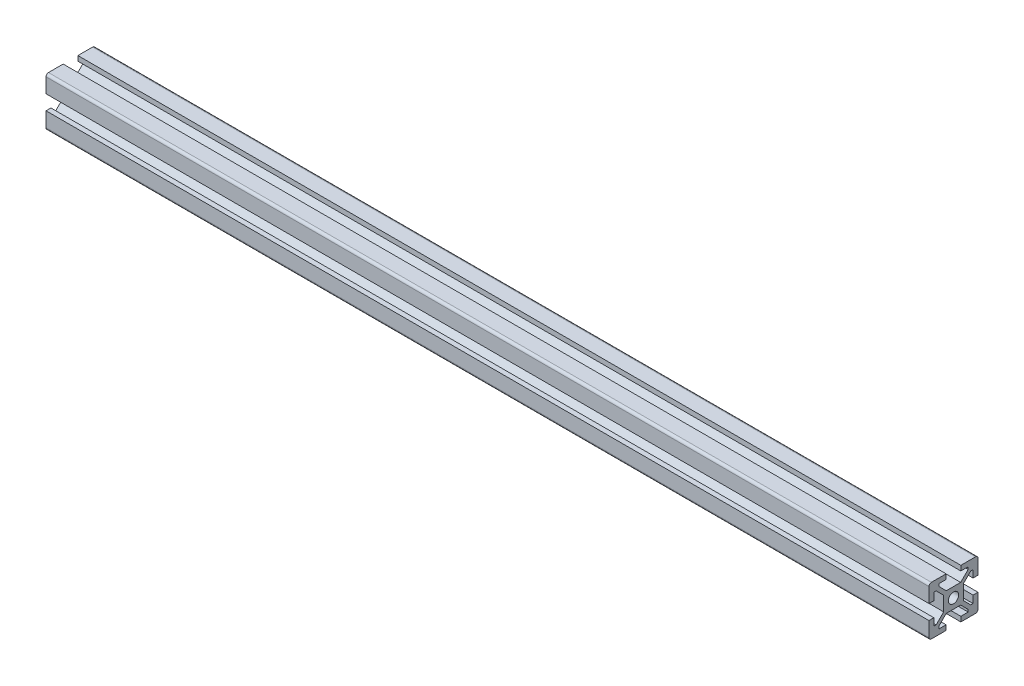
ISO-10303-21;
HEADER;
FILE_DESCRIPTION(('STEP AP214'),'2;1');
FILE_NAME('part.step','',(''),(''),'','','');
FILE_SCHEMA(('AUTOMOTIVE_DESIGN { 1 0 10303 214 1 1 1 1 }'));
ENDSEC;
DATA;
#1=APPLICATION_CONTEXT('core data for automotive mechanical design processes');
#2=APPLICATION_PROTOCOL_DEFINITION('international standard','automotive_design',2000,#1);
#3=PRODUCT_CONTEXT('',#1,'mechanical');
#4=PRODUCT('Part','Part','',(#3));
#5=PRODUCT_RELATED_PRODUCT_CATEGORY('part','',(#4));
#6=PRODUCT_DEFINITION_FORMATION('','',#4);
#7=PRODUCT_DEFINITION_CONTEXT('part definition',#1,'design');
#8=PRODUCT_DEFINITION('design','',#6,#7);
#9=PRODUCT_DEFINITION_SHAPE('','',#8);
#10=(LENGTH_UNIT() NAMED_UNIT(*) SI_UNIT(.MILLI.,.METRE.));
#11=(NAMED_UNIT(*) PLANE_ANGLE_UNIT() SI_UNIT($,.RADIAN.));
#12=(NAMED_UNIT(*) SI_UNIT($,.STERADIAN.) SOLID_ANGLE_UNIT());
#13=UNCERTAINTY_MEASURE_WITH_UNIT(LENGTH_MEASURE(1.E-05),#10,'distance_accuracy_value','');
#14=(GEOMETRIC_REPRESENTATION_CONTEXT(3) GLOBAL_UNCERTAINTY_ASSIGNED_CONTEXT((#13)) GLOBAL_UNIT_ASSIGNED_CONTEXT((#10,
#11,#12)) REPRESENTATION_CONTEXT('',''));
#15=CARTESIAN_POINT('',(0.,0.,0.));
#16=DIRECTION('',(0.,0.,1.));
#17=DIRECTION('',(1.,0.,0.));
#18=AXIS2_PLACEMENT_3D('',#15,#16,#17);
#19=CARTESIAN_POINT('',(360.,9.,9.));
#20=DIRECTION('',(1.,0.,0.));
#21=DIRECTION('',(0.,0.,-1.));
#22=AXIS2_PLACEMENT_3D('',#19,#20,#21);
#23=PLANE('',#22);
#24=CARTESIAN_POINT('',(360.,9.,9.));
#25=DIRECTION('',(1.,0.,0.));
#26=DIRECTION('',(0.,0.,-1.));
#27=AXIS2_PLACEMENT_3D('',#24,#25,#26);
#28=CIRCLE('',#27,1.);
#29=CARTESIAN_POINT('',(360.,10.,9.));
#30=VERTEX_POINT('',#29);
#31=CARTESIAN_POINT('',(360.,9.,10.));
#32=VERTEX_POINT('',#31);
#33=EDGE_CURVE('E467',#30,#32,#28,.T.);
#34=ORIENTED_EDGE('',*,*,#33,.T.);
#35=DIRECTION('',(0.,-1.,0.));
#36=VECTOR('',#35,1.);
#37=CARTESIAN_POINT('',(360.,9.,10.));
#38=LINE('',#37,#36);
#39=CARTESIAN_POINT('',(360.,3.,10.));
#40=VERTEX_POINT('',#39);
#41=EDGE_CURVE('E215',#32,#40,#38,.T.);
#42=ORIENTED_EDGE('',*,*,#41,.T.);
#43=DIRECTION('',(0.,0.,-1.));
#44=VECTOR('',#43,1.);
#45=CARTESIAN_POINT('',(360.,3.,10.));
#46=LINE('',#45,#44);
#47=CARTESIAN_POINT('',(360.,3.,8.));
#48=VERTEX_POINT('',#47);
#49=EDGE_CURVE('E602',#40,#48,#46,.T.);
#50=ORIENTED_EDGE('',*,*,#49,.T.);
#51=DIRECTION('',(0.,1.,0.));
#52=VECTOR('',#51,1.);
#53=CARTESIAN_POINT('',(360.,3.,8.));
#54=LINE('',#53,#52);
#55=CARTESIAN_POINT('',(360.,6.,8.));
#56=VERTEX_POINT('',#55);
#57=EDGE_CURVE('E621',#48,#56,#54,.T.);
#58=ORIENTED_EDGE('',*,*,#57,.T.);
#59=DIRECTION('',(0.,0.,-1.));
#60=VECTOR('',#59,1.);
#61=CARTESIAN_POINT('',(360.,6.,8.));
#62=LINE('',#61,#60);
#63=CARTESIAN_POINT('',(360.,6.,7.06066017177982));
#64=VERTEX_POINT('',#63);
#65=EDGE_CURVE('E618',#56,#64,#62,.T.);
#66=ORIENTED_EDGE('',*,*,#65,.T.);
#67=DIRECTION('',(0.,-0.707106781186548,-0.707106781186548));
#68=VECTOR('',#67,1.);
#69=CARTESIAN_POINT('',(360.,6.,7.06066017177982));
#70=LINE('',#69,#68);
#71=CARTESIAN_POINT('',(360.,2.93933982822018,4.));
#72=VERTEX_POINT('',#71);
#73=EDGE_CURVE('E620',#64,#72,#70,.T.);
#74=ORIENTED_EDGE('',*,*,#73,.T.);
#75=DIRECTION('',(0.,-1.,0.));
#76=VECTOR('',#75,1.);
#77=CARTESIAN_POINT('',(360.,2.93933982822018,4.));
#78=LINE('',#77,#76);
#79=CARTESIAN_POINT('',(360.,-2.93933982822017,4.));
#80=VERTEX_POINT('',#79);
#81=EDGE_CURVE('E623',#72,#80,#78,.T.);
#82=ORIENTED_EDGE('',*,*,#81,.T.);
#83=DIRECTION('',(0.,-0.707106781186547,0.707106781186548));
#84=VECTOR('',#83,1.);
#85=CARTESIAN_POINT('',(360.,-2.93933982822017,4.));
#86=LINE('',#85,#84);
#87=CARTESIAN_POINT('',(360.,-6.,7.06066017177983));
#88=VERTEX_POINT('',#87);
#89=EDGE_CURVE('E629',#80,#88,#86,.T.);
#90=ORIENTED_EDGE('',*,*,#89,.T.);
#91=DIRECTION('',(0.,0.,1.));
#92=VECTOR('',#91,1.);
#93=CARTESIAN_POINT('',(360.,-6.,7.06066017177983));
#94=LINE('',#93,#92);
#95=CARTESIAN_POINT('',(360.,-6.,7.99999999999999));
#96=VERTEX_POINT('',#95);
#97=EDGE_CURVE('E631',#88,#96,#94,.T.);
#98=ORIENTED_EDGE('',*,*,#97,.T.);
#99=DIRECTION('',(0.,1.,0.));
#100=VECTOR('',#99,1.);
#101=CARTESIAN_POINT('',(360.,-6.,7.99999999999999));
#102=LINE('',#101,#100);
#103=CARTESIAN_POINT('',(360.,-3.,7.99999999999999));
#104=VERTEX_POINT('',#103);
#105=EDGE_CURVE('E633',#96,#104,#102,.T.);
#106=ORIENTED_EDGE('',*,*,#105,.T.);
#107=DIRECTION('',(0.,0.,1.));
#108=VECTOR('',#107,1.);
#109=CARTESIAN_POINT('',(360.,-3.,7.99999999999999));
#110=LINE('',#109,#108);
#111=CARTESIAN_POINT('',(360.,-3.,10.));
#112=VERTEX_POINT('',#111);
#113=EDGE_CURVE('E635',#104,#112,#110,.T.);
#114=ORIENTED_EDGE('',*,*,#113,.T.);
#115=DIRECTION('',(0.,-1.,0.));
#116=VECTOR('',#115,1.);
#117=CARTESIAN_POINT('',(360.,-3.,10.));
#118=LINE('',#117,#116);
#119=CARTESIAN_POINT('',(360.,-9.,10.));
#120=VERTEX_POINT('',#119);
#121=EDGE_CURVE('E637',#112,#120,#118,.T.);
#122=ORIENTED_EDGE('',*,*,#121,.T.);
#123=CARTESIAN_POINT('',(360.,-9.,9.));
#124=DIRECTION('',(1.,0.,0.));
#125=DIRECTION('',(0.,0.,-1.));
#126=AXIS2_PLACEMENT_3D('',#123,#124,#125);
#127=CIRCLE('',#126,1.);
#128=CARTESIAN_POINT('',(360.,-10.,9.));
#129=VERTEX_POINT('',#128);
#130=EDGE_CURVE('E639',#120,#129,#127,.T.);
#131=ORIENTED_EDGE('',*,*,#130,.T.);
#132=DIRECTION('',(0.,0.,-1.));
#133=VECTOR('',#132,1.);
#134=CARTESIAN_POINT('',(360.,-10.,9.));
#135=LINE('',#134,#133);
#136=CARTESIAN_POINT('',(360.,-10.,3.));
#137=VERTEX_POINT('',#136);
#138=EDGE_CURVE('E641',#129,#137,#135,.T.);
#139=ORIENTED_EDGE('',*,*,#138,.T.);
#140=DIRECTION('',(0.,1.,0.));
#141=VECTOR('',#140,1.);
#142=CARTESIAN_POINT('',(360.,-10.,3.));
#143=LINE('',#142,#141);
#144=CARTESIAN_POINT('',(360.,-8.,3.));
#145=VERTEX_POINT('',#144);
#146=EDGE_CURVE('E643',#137,#145,#143,.T.);
#147=ORIENTED_EDGE('',*,*,#146,.T.);
#148=DIRECTION('',(0.,0.,1.));
#149=VECTOR('',#148,1.);
#150=CARTESIAN_POINT('',(360.,-8.,3.));
#151=LINE('',#150,#149);
#152=CARTESIAN_POINT('',(360.,-8.,6.));
#153=VERTEX_POINT('',#152);
#154=EDGE_CURVE('E645',#145,#153,#151,.T.);
#155=ORIENTED_EDGE('',*,*,#154,.T.);
#156=DIRECTION('',(0.,1.,0.));
#157=VECTOR('',#156,1.);
#158=CARTESIAN_POINT('',(360.,-8.,6.));
#159=LINE('',#158,#157);
#160=CARTESIAN_POINT('',(360.,-7.06066017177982,6.));
#161=VERTEX_POINT('',#160);
#162=EDGE_CURVE('E647',#153,#161,#159,.T.);
#163=ORIENTED_EDGE('',*,*,#162,.T.);
#164=DIRECTION('',(0.,0.707106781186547,-0.707106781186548));
#165=VECTOR('',#164,1.);
#166=CARTESIAN_POINT('',(360.,-7.06066017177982,6.));
#167=LINE('',#166,#165);
#168=CARTESIAN_POINT('',(360.,-4.,2.93933982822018));
#169=VERTEX_POINT('',#168);
#170=EDGE_CURVE('E649',#161,#169,#167,.T.);
#171=ORIENTED_EDGE('',*,*,#170,.T.);
#172=DIRECTION('',(0.,0.,-1.));
#173=VECTOR('',#172,1.);
#174=CARTESIAN_POINT('',(360.,-4.,2.93933982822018));
#175=LINE('',#174,#173);
#176=CARTESIAN_POINT('',(360.,-4.,-2.93933982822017));
#177=VERTEX_POINT('',#176);
#178=EDGE_CURVE('E651',#169,#177,#175,.T.);
#179=ORIENTED_EDGE('',*,*,#178,.T.);
#180=DIRECTION('',(0.,-0.707106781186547,-0.707106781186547));
#181=VECTOR('',#180,1.);
#182=CARTESIAN_POINT('',(360.,-4.,-2.93933982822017));
#183=LINE('',#182,#181);
#184=CARTESIAN_POINT('',(360.,-7.06066017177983,-6.));
#185=VERTEX_POINT('',#184);
#186=EDGE_CURVE('E653',#177,#185,#183,.T.);
#187=ORIENTED_EDGE('',*,*,#186,.T.);
#188=DIRECTION('',(0.,-1.,0.));
#189=VECTOR('',#188,1.);
#190=CARTESIAN_POINT('',(360.,-7.06066017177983,-6.));
#191=LINE('',#190,#189);
#192=CARTESIAN_POINT('',(360.,-7.99999999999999,-6.));
#193=VERTEX_POINT('',#192);
#194=EDGE_CURVE('E655',#185,#193,#191,.T.);
#195=ORIENTED_EDGE('',*,*,#194,.T.);
#196=DIRECTION('',(0.,0.,1.));
#197=VECTOR('',#196,1.);
#198=CARTESIAN_POINT('',(360.,-7.99999999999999,-6.));
#199=LINE('',#198,#197);
#200=CARTESIAN_POINT('',(360.,-7.99999999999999,-3.));
#201=VERTEX_POINT('',#200);
#202=EDGE_CURVE('E657',#193,#201,#199,.T.);
#203=ORIENTED_EDGE('',*,*,#202,.T.);
#204=DIRECTION('',(0.,-1.,0.));
#205=VECTOR('',#204,1.);
#206=CARTESIAN_POINT('',(360.,-7.99999999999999,-3.));
#207=LINE('',#206,#205);
#208=CARTESIAN_POINT('',(360.,-10.,-3.));
#209=VERTEX_POINT('',#208);
#210=EDGE_CURVE('E659',#201,#209,#207,.T.);
#211=ORIENTED_EDGE('',*,*,#210,.T.);
#212=DIRECTION('',(0.,0.,-1.));
#213=VECTOR('',#212,1.);
#214=CARTESIAN_POINT('',(360.,-10.,-3.));
#215=LINE('',#214,#213);
#216=CARTESIAN_POINT('',(360.,-10.,-9.00000000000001));
#217=VERTEX_POINT('',#216);
#218=EDGE_CURVE('E661',#209,#217,#215,.T.);
#219=ORIENTED_EDGE('',*,*,#218,.T.);
#220=CARTESIAN_POINT('',(360.,-9.,-9.00000000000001));
#221=DIRECTION('',(1.,0.,0.));
#222=DIRECTION('',(0.,0.,-1.));
#223=AXIS2_PLACEMENT_3D('',#220,#221,#222);
#224=CIRCLE('',#223,0.999999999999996);
#225=CARTESIAN_POINT('',(360.,-9.,-10.));
#226=VERTEX_POINT('',#225);
#227=EDGE_CURVE('E663',#217,#226,#224,.T.);
#228=ORIENTED_EDGE('',*,*,#227,.T.);
#229=DIRECTION('',(0.,1.,0.));
#230=VECTOR('',#229,1.);
#231=CARTESIAN_POINT('',(360.,-9.,-10.));
#232=LINE('',#231,#230);
#233=CARTESIAN_POINT('',(360.,-3.,-10.));
#234=VERTEX_POINT('',#233);
#235=EDGE_CURVE('E665',#226,#234,#232,.T.);
#236=ORIENTED_EDGE('',*,*,#235,.T.);
#237=DIRECTION('',(0.,0.,1.));
#238=VECTOR('',#237,1.);
#239=CARTESIAN_POINT('',(360.,-3.,-10.));
#240=LINE('',#239,#238);
#241=CARTESIAN_POINT('',(360.,-3.,-8.00000000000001));
#242=VERTEX_POINT('',#241);
#243=EDGE_CURVE('E667',#234,#242,#240,.T.);
#244=ORIENTED_EDGE('',*,*,#243,.T.);
#245=DIRECTION('',(0.,-1.,0.));
#246=VECTOR('',#245,1.);
#247=CARTESIAN_POINT('',(360.,-3.,-8.00000000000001));
#248=LINE('',#247,#246);
#249=CARTESIAN_POINT('',(360.,-6.,-8.00000000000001));
#250=VERTEX_POINT('',#249);
#251=EDGE_CURVE('E669',#242,#250,#248,.T.);
#252=ORIENTED_EDGE('',*,*,#251,.T.);
#253=DIRECTION('',(0.,0.,1.));
#254=VECTOR('',#253,1.);
#255=CARTESIAN_POINT('',(360.,-6.,-8.00000000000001));
#256=LINE('',#255,#254);
#257=CARTESIAN_POINT('',(360.,-6.,-7.06066017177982));
#258=VERTEX_POINT('',#257);
#259=EDGE_CURVE('E671',#250,#258,#256,.T.);
#260=ORIENTED_EDGE('',*,*,#259,.T.);
#261=DIRECTION('',(0.,0.707106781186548,0.707106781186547));
#262=VECTOR('',#261,1.);
#263=CARTESIAN_POINT('',(360.,-6.,-7.06066017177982));
#264=LINE('',#263,#262);
#265=CARTESIAN_POINT('',(360.,-2.93933982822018,-4.));
#266=VERTEX_POINT('',#265);
#267=EDGE_CURVE('E673',#258,#266,#264,.T.);
#268=ORIENTED_EDGE('',*,*,#267,.T.);
#269=DIRECTION('',(0.,1.,0.));
#270=VECTOR('',#269,1.);
#271=CARTESIAN_POINT('',(360.,-2.93933982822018,-4.));
#272=LINE('',#271,#270);
#273=CARTESIAN_POINT('',(360.,2.93933982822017,-4.));
#274=VERTEX_POINT('',#273);
#275=EDGE_CURVE('E675',#266,#274,#272,.T.);
#276=ORIENTED_EDGE('',*,*,#275,.T.);
#277=DIRECTION('',(0.,0.707106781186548,-0.707106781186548));
#278=VECTOR('',#277,1.);
#279=CARTESIAN_POINT('',(360.,2.93933982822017,-4.));
#280=LINE('',#279,#278);
#281=CARTESIAN_POINT('',(360.,6.,-7.06066017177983));
#282=VERTEX_POINT('',#281);
#283=EDGE_CURVE('E677',#274,#282,#280,.T.);
#284=ORIENTED_EDGE('',*,*,#283,.T.);
#285=DIRECTION('',(0.,0.,-1.));
#286=VECTOR('',#285,1.);
#287=CARTESIAN_POINT('',(360.,6.,-7.06066017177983));
#288=LINE('',#287,#286);
#289=CARTESIAN_POINT('',(360.,6.,-7.99999999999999));
#290=VERTEX_POINT('',#289);
#291=EDGE_CURVE('E679',#282,#290,#288,.T.);
#292=ORIENTED_EDGE('',*,*,#291,.T.);
#293=DIRECTION('',(0.,-1.,0.));
#294=VECTOR('',#293,1.);
#295=CARTESIAN_POINT('',(360.,6.,-7.99999999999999));
#296=LINE('',#295,#294);
#297=CARTESIAN_POINT('',(360.,3.,-7.99999999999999));
#298=VERTEX_POINT('',#297);
#299=EDGE_CURVE('E681',#290,#298,#296,.T.);
#300=ORIENTED_EDGE('',*,*,#299,.T.);
#301=DIRECTION('',(0.,0.,-1.));
#302=VECTOR('',#301,1.);
#303=CARTESIAN_POINT('',(360.,3.,-7.99999999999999));
#304=LINE('',#303,#302);
#305=CARTESIAN_POINT('',(360.,3.,-10.));
#306=VERTEX_POINT('',#305);
#307=EDGE_CURVE('E683',#298,#306,#304,.T.);
#308=ORIENTED_EDGE('',*,*,#307,.T.);
#309=DIRECTION('',(0.,1.,0.));
#310=VECTOR('',#309,1.);
#311=CARTESIAN_POINT('',(360.,3.,-10.));
#312=LINE('',#311,#310);
#313=CARTESIAN_POINT('',(360.,9.,-10.));
#314=VERTEX_POINT('',#313);
#315=EDGE_CURVE('E685',#306,#314,#312,.T.);
#316=ORIENTED_EDGE('',*,*,#315,.T.);
#317=CARTESIAN_POINT('',(360.,9.,-9.00000000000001));
#318=DIRECTION('',(1.,0.,0.));
#319=DIRECTION('',(0.,0.,-1.));
#320=AXIS2_PLACEMENT_3D('',#317,#318,#319);
#321=CIRCLE('',#320,1.);
#322=CARTESIAN_POINT('',(360.,10.,-9.00000000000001));
#323=VERTEX_POINT('',#322);
#324=EDGE_CURVE('E687',#314,#323,#321,.T.);
#325=ORIENTED_EDGE('',*,*,#324,.T.);
#326=DIRECTION('',(0.,0.,1.));
#327=VECTOR('',#326,1.);
#328=CARTESIAN_POINT('',(360.,10.,-9.00000000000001));
#329=LINE('',#328,#327);
#330=CARTESIAN_POINT('',(360.,10.,-3.));
#331=VERTEX_POINT('',#330);
#332=EDGE_CURVE('E689',#323,#331,#329,.T.);
#333=ORIENTED_EDGE('',*,*,#332,.T.);
#334=DIRECTION('',(0.,-1.,0.));
#335=VECTOR('',#334,1.);
#336=CARTESIAN_POINT('',(360.,10.,-3.));
#337=LINE('',#336,#335);
#338=CARTESIAN_POINT('',(360.,8.,-3.));
#339=VERTEX_POINT('',#338);
#340=EDGE_CURVE('E691',#331,#339,#337,.T.);
#341=ORIENTED_EDGE('',*,*,#340,.T.);
#342=DIRECTION('',(0.,0.,-1.));
#343=VECTOR('',#342,1.);
#344=CARTESIAN_POINT('',(360.,8.,-3.));
#345=LINE('',#344,#343);
#346=CARTESIAN_POINT('',(360.,8.,-6.));
#347=VERTEX_POINT('',#346);
#348=EDGE_CURVE('E693',#339,#347,#345,.T.);
#349=ORIENTED_EDGE('',*,*,#348,.T.);
#350=DIRECTION('',(0.,-1.,0.));
#351=VECTOR('',#350,1.);
#352=CARTESIAN_POINT('',(360.,8.,-6.));
#353=LINE('',#352,#351);
#354=CARTESIAN_POINT('',(360.,7.06066017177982,-6.));
#355=VERTEX_POINT('',#354);
#356=EDGE_CURVE('E695',#347,#355,#353,.T.);
#357=ORIENTED_EDGE('',*,*,#356,.T.);
#358=DIRECTION('',(0.,-0.707106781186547,0.707106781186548));
#359=VECTOR('',#358,1.);
#360=CARTESIAN_POINT('',(360.,7.06066017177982,-6.));
#361=LINE('',#360,#359);
#362=CARTESIAN_POINT('',(360.,4.,-2.93933982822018));
#363=VERTEX_POINT('',#362);
#364=EDGE_CURVE('E697',#355,#363,#361,.T.);
#365=ORIENTED_EDGE('',*,*,#364,.T.);
#366=DIRECTION('',(0.,0.,1.));
#367=VECTOR('',#366,1.);
#368=CARTESIAN_POINT('',(360.,4.,-2.93933982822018));
#369=LINE('',#368,#367);
#370=CARTESIAN_POINT('',(360.,4.,2.93933982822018));
#371=VERTEX_POINT('',#370);
#372=EDGE_CURVE('E699',#363,#371,#369,.T.);
#373=ORIENTED_EDGE('',*,*,#372,.T.);
#374=DIRECTION('',(0.,0.707106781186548,0.707106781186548));
#375=VECTOR('',#374,1.);
#376=CARTESIAN_POINT('',(360.,4.,2.93933982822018));
#377=LINE('',#376,#375);
#378=CARTESIAN_POINT('',(360.,7.06066017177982,6.));
#379=VERTEX_POINT('',#378);
#380=EDGE_CURVE('E701',#371,#379,#377,.T.);
#381=ORIENTED_EDGE('',*,*,#380,.T.);
#382=DIRECTION('',(0.,1.,0.));
#383=VECTOR('',#382,1.);
#384=CARTESIAN_POINT('',(360.,7.06066017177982,6.));
#385=LINE('',#384,#383);
#386=CARTESIAN_POINT('',(360.,7.99999999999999,6.));
#387=VERTEX_POINT('',#386);
#388=EDGE_CURVE('E354',#379,#387,#385,.T.);
#389=ORIENTED_EDGE('',*,*,#388,.T.);
#390=DIRECTION('',(0.,0.,-1.));
#391=VECTOR('',#390,1.);
#392=CARTESIAN_POINT('',(360.,7.99999999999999,6.));
#393=LINE('',#392,#391);
#394=CARTESIAN_POINT('',(360.,7.99999999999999,3.));
#395=VERTEX_POINT('',#394);
#396=EDGE_CURVE('E348',#387,#395,#393,.T.);
#397=ORIENTED_EDGE('',*,*,#396,.T.);
#398=DIRECTION('',(0.,1.,0.));
#399=VECTOR('',#398,1.);
#400=CARTESIAN_POINT('',(360.,7.99999999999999,3.));
#401=LINE('',#400,#399);
#402=CARTESIAN_POINT('',(360.,10.,3.));
#403=VERTEX_POINT('',#402);
#404=EDGE_CURVE('E352',#395,#403,#401,.T.);
#405=ORIENTED_EDGE('',*,*,#404,.T.);
#406=DIRECTION('',(0.,0.,1.));
#407=VECTOR('',#406,1.);
#408=CARTESIAN_POINT('',(360.,10.,3.));
#409=LINE('',#408,#407);
#410=EDGE_CURVE('E52',#403,#30,#409,.T.);
#411=ORIENTED_EDGE('',*,*,#410,.T.);
#412=EDGE_LOOP('',(#34,#42,#50,#58,#66,#74,#82,#90,#98,#106,#114,#122,#131,#139,#147,#155,#163,
#171,#179,#187,#195,#203,#211,#219,#228,#236,#244,#252,#260,#268,#276,#284,#292,#300,#308,#316,
#325,#333,#341,#349,#357,#365,#373,#381,#389,#397,#405,#411));
#413=FACE_BOUND('',#412,.T.);
#414=CARTESIAN_POINT('',(360.,0.,0.));
#415=DIRECTION('',(1.,0.,0.));
#416=DIRECTION('',(0.,0.,-1.));
#417=AXIS2_PLACEMENT_3D('',#414,#415,#416);
#418=CIRCLE('',#417,2.1);
#419=CARTESIAN_POINT('',(360.,0.,2.1));
#420=VERTEX_POINT('',#419);
#421=EDGE_CURVE('E376',#420,#420,#418,.T.);
#422=ORIENTED_EDGE('',*,*,#421,.F.);
#423=EDGE_LOOP('',(#422));
#424=FACE_BOUND('',#423,.T.);
#425=ADVANCED_FACE('F35',(#413,#424),#23,.T.);
#426=CARTESIAN_POINT('',(0.,9.,9.));
#427=DIRECTION('',(1.,0.,0.));
#428=DIRECTION('',(0.,0.,-1.));
#429=AXIS2_PLACEMENT_3D('',#426,#427,#428);
#430=PLANE('',#429);
#431=CARTESIAN_POINT('',(0.,9.,9.));
#432=DIRECTION('',(1.,0.,0.));
#433=DIRECTION('',(0.,0.,-1.));
#434=AXIS2_PLACEMENT_3D('',#431,#432,#433);
#435=CIRCLE('',#434,1.);
#436=CARTESIAN_POINT('',(0.,10.,9.));
#437=VERTEX_POINT('',#436);
#438=CARTESIAN_POINT('',(0.,9.,10.));
#439=VERTEX_POINT('',#438);
#440=EDGE_CURVE('E372',#437,#439,#435,.T.);
#441=ORIENTED_EDGE('',*,*,#440,.F.);
#442=DIRECTION('',(0.,0.,1.));
#443=VECTOR('',#442,1.);
#444=CARTESIAN_POINT('',(0.,10.,3.));
#445=LINE('',#444,#443);
#446=CARTESIAN_POINT('',(0.,10.,3.));
#447=VERTEX_POINT('',#446);
#448=EDGE_CURVE('E207',#447,#437,#445,.T.);
#449=ORIENTED_EDGE('',*,*,#448,.F.);
#450=DIRECTION('',(0.,1.,0.));
#451=VECTOR('',#450,1.);
#452=CARTESIAN_POINT('',(0.,7.99999999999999,3.));
#453=LINE('',#452,#451);
#454=CARTESIAN_POINT('',(0.,7.99999999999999,3.));
#455=VERTEX_POINT('',#454);
#456=EDGE_CURVE('E201',#455,#447,#453,.T.);
#457=ORIENTED_EDGE('',*,*,#456,.F.);
#458=DIRECTION('',(0.,0.,-1.));
#459=VECTOR('',#458,1.);
#460=CARTESIAN_POINT('',(0.,7.99999999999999,6.));
#461=LINE('',#460,#459);
#462=CARTESIAN_POINT('',(0.,7.99999999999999,6.));
#463=VERTEX_POINT('',#462);
#464=EDGE_CURVE('E362',#463,#455,#461,.T.);
#465=ORIENTED_EDGE('',*,*,#464,.F.);
#466=DIRECTION('',(0.,1.,0.));
#467=VECTOR('',#466,1.);
#468=CARTESIAN_POINT('',(0.,7.06066017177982,6.));
#469=LINE('',#468,#467);
#470=CARTESIAN_POINT('',(0.,7.06066017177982,6.));
#471=VERTEX_POINT('',#470);
#472=EDGE_CURVE('E462',#471,#463,#469,.T.);
#473=ORIENTED_EDGE('',*,*,#472,.F.);
#474=DIRECTION('',(0.,0.707106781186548,0.707106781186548));
#475=VECTOR('',#474,1.);
#476=CARTESIAN_POINT('',(0.,4.,2.93933982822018));
#477=LINE('',#476,#475);
#478=CARTESIAN_POINT('',(0.,4.,2.93933982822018));
#479=VERTEX_POINT('',#478);
#480=EDGE_CURVE('E460',#479,#471,#477,.T.);
#481=ORIENTED_EDGE('',*,*,#480,.F.);
#482=DIRECTION('',(0.,0.,1.));
#483=VECTOR('',#482,1.);
#484=CARTESIAN_POINT('',(0.,4.,-2.93933982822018));
#485=LINE('',#484,#483);
#486=CARTESIAN_POINT('',(0.,4.,-2.93933982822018));
#487=VERTEX_POINT('',#486);
#488=EDGE_CURVE('E458',#487,#479,#485,.T.);
#489=ORIENTED_EDGE('',*,*,#488,.F.);
#490=DIRECTION('',(0.,-0.707106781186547,0.707106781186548));
#491=VECTOR('',#490,1.);
#492=CARTESIAN_POINT('',(0.,7.06066017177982,-6.));
#493=LINE('',#492,#491);
#494=CARTESIAN_POINT('',(0.,7.06066017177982,-6.));
#495=VERTEX_POINT('',#494);
#496=EDGE_CURVE('E456',#495,#487,#493,.T.);
#497=ORIENTED_EDGE('',*,*,#496,.F.);
#498=DIRECTION('',(0.,-1.,0.));
#499=VECTOR('',#498,1.);
#500=CARTESIAN_POINT('',(0.,8.,-6.));
#501=LINE('',#500,#499);
#502=CARTESIAN_POINT('',(0.,8.,-6.));
#503=VERTEX_POINT('',#502);
#504=EDGE_CURVE('E454',#503,#495,#501,.T.);
#505=ORIENTED_EDGE('',*,*,#504,.F.);
#506=DIRECTION('',(0.,0.,-1.));
#507=VECTOR('',#506,1.);
#508=CARTESIAN_POINT('',(0.,8.,-3.));
#509=LINE('',#508,#507);
#510=CARTESIAN_POINT('',(0.,8.,-3.));
#511=VERTEX_POINT('',#510);
#512=EDGE_CURVE('E452',#511,#503,#509,.T.);
#513=ORIENTED_EDGE('',*,*,#512,.F.);
#514=DIRECTION('',(0.,-1.,0.));
#515=VECTOR('',#514,1.);
#516=CARTESIAN_POINT('',(0.,10.,-3.));
#517=LINE('',#516,#515);
#518=CARTESIAN_POINT('',(0.,10.,-3.));
#519=VERTEX_POINT('',#518);
#520=EDGE_CURVE('E450',#519,#511,#517,.T.);
#521=ORIENTED_EDGE('',*,*,#520,.F.);
#522=DIRECTION('',(0.,0.,1.));
#523=VECTOR('',#522,1.);
#524=CARTESIAN_POINT('',(0.,10.,-9.00000000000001));
#525=LINE('',#524,#523);
#526=CARTESIAN_POINT('',(0.,10.,-9.00000000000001));
#527=VERTEX_POINT('',#526);
#528=EDGE_CURVE('E448',#527,#519,#525,.T.);
#529=ORIENTED_EDGE('',*,*,#528,.F.);
#530=CARTESIAN_POINT('',(0.,9.,-9.00000000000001));
#531=DIRECTION('',(1.,0.,0.));
#532=DIRECTION('',(0.,0.,-1.));
#533=AXIS2_PLACEMENT_3D('',#530,#531,#532);
#534=CIRCLE('',#533,1.);
#535=CARTESIAN_POINT('',(0.,9.,-10.));
#536=VERTEX_POINT('',#535);
#537=EDGE_CURVE('E446',#536,#527,#534,.T.);
#538=ORIENTED_EDGE('',*,*,#537,.F.);
#539=DIRECTION('',(0.,1.,0.));
#540=VECTOR('',#539,1.);
#541=CARTESIAN_POINT('',(0.,3.,-10.));
#542=LINE('',#541,#540);
#543=CARTESIAN_POINT('',(0.,3.,-10.));
#544=VERTEX_POINT('',#543);
#545=EDGE_CURVE('E444',#544,#536,#542,.T.);
#546=ORIENTED_EDGE('',*,*,#545,.F.);
#547=DIRECTION('',(0.,0.,-1.));
#548=VECTOR('',#547,1.);
#549=CARTESIAN_POINT('',(0.,3.,-7.99999999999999));
#550=LINE('',#549,#548);
#551=CARTESIAN_POINT('',(0.,3.,-7.99999999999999));
#552=VERTEX_POINT('',#551);
#553=EDGE_CURVE('E442',#552,#544,#550,.T.);
#554=ORIENTED_EDGE('',*,*,#553,.F.);
#555=DIRECTION('',(0.,-1.,0.));
#556=VECTOR('',#555,1.);
#557=CARTESIAN_POINT('',(0.,6.,-7.99999999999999));
#558=LINE('',#557,#556);
#559=CARTESIAN_POINT('',(0.,6.,-7.99999999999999));
#560=VERTEX_POINT('',#559);
#561=EDGE_CURVE('E440',#560,#552,#558,.T.);
#562=ORIENTED_EDGE('',*,*,#561,.F.);
#563=DIRECTION('',(0.,0.,-1.));
#564=VECTOR('',#563,1.);
#565=CARTESIAN_POINT('',(0.,6.,-7.06066017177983));
#566=LINE('',#565,#564);
#567=CARTESIAN_POINT('',(0.,6.,-7.06066017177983));
#568=VERTEX_POINT('',#567);
#569=EDGE_CURVE('E438',#568,#560,#566,.T.);
#570=ORIENTED_EDGE('',*,*,#569,.F.);
#571=DIRECTION('',(0.,0.707106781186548,-0.707106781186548));
#572=VECTOR('',#571,1.);
#573=CARTESIAN_POINT('',(0.,2.93933982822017,-4.));
#574=LINE('',#573,#572);
#575=CARTESIAN_POINT('',(0.,2.93933982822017,-4.));
#576=VERTEX_POINT('',#575);
#577=EDGE_CURVE('E436',#576,#568,#574,.T.);
#578=ORIENTED_EDGE('',*,*,#577,.F.);
#579=DIRECTION('',(0.,1.,0.));
#580=VECTOR('',#579,1.);
#581=CARTESIAN_POINT('',(0.,-2.93933982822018,-4.));
#582=LINE('',#581,#580);
#583=CARTESIAN_POINT('',(0.,-2.93933982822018,-4.));
#584=VERTEX_POINT('',#583);
#585=EDGE_CURVE('E434',#584,#576,#582,.T.);
#586=ORIENTED_EDGE('',*,*,#585,.F.);
#587=DIRECTION('',(0.,0.707106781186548,0.707106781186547));
#588=VECTOR('',#587,1.);
#589=CARTESIAN_POINT('',(0.,-6.,-7.06066017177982));
#590=LINE('',#589,#588);
#591=CARTESIAN_POINT('',(0.,-6.,-7.06066017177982));
#592=VERTEX_POINT('',#591);
#593=EDGE_CURVE('E432',#592,#584,#590,.T.);
#594=ORIENTED_EDGE('',*,*,#593,.F.);
#595=DIRECTION('',(0.,0.,1.));
#596=VECTOR('',#595,1.);
#597=CARTESIAN_POINT('',(0.,-6.,-8.00000000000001));
#598=LINE('',#597,#596);
#599=CARTESIAN_POINT('',(0.,-6.,-8.00000000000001));
#600=VERTEX_POINT('',#599);
#601=EDGE_CURVE('E430',#600,#592,#598,.T.);
#602=ORIENTED_EDGE('',*,*,#601,.F.);
#603=DIRECTION('',(0.,-1.,0.));
#604=VECTOR('',#603,1.);
#605=CARTESIAN_POINT('',(0.,-3.,-8.00000000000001));
#606=LINE('',#605,#604);
#607=CARTESIAN_POINT('',(0.,-3.,-8.00000000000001));
#608=VERTEX_POINT('',#607);
#609=EDGE_CURVE('E428',#608,#600,#606,.T.);
#610=ORIENTED_EDGE('',*,*,#609,.F.);
#611=DIRECTION('',(0.,0.,1.));
#612=VECTOR('',#611,1.);
#613=CARTESIAN_POINT('',(0.,-3.,-10.));
#614=LINE('',#613,#612);
#615=CARTESIAN_POINT('',(0.,-3.,-10.));
#616=VERTEX_POINT('',#615);
#617=EDGE_CURVE('E426',#616,#608,#614,.T.);
#618=ORIENTED_EDGE('',*,*,#617,.F.);
#619=DIRECTION('',(0.,1.,0.));
#620=VECTOR('',#619,1.);
#621=CARTESIAN_POINT('',(0.,-9.,-10.));
#622=LINE('',#621,#620);
#623=CARTESIAN_POINT('',(0.,-9.,-10.));
#624=VERTEX_POINT('',#623);
#625=EDGE_CURVE('E424',#624,#616,#622,.T.);
#626=ORIENTED_EDGE('',*,*,#625,.F.);
#627=CARTESIAN_POINT('',(0.,-9.,-9.00000000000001));
#628=DIRECTION('',(1.,0.,0.));
#629=DIRECTION('',(0.,0.,-1.));
#630=AXIS2_PLACEMENT_3D('',#627,#628,#629);
#631=CIRCLE('',#630,0.999999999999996);
#632=CARTESIAN_POINT('',(0.,-10.,-9.00000000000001));
#633=VERTEX_POINT('',#632);
#634=EDGE_CURVE('E422',#633,#624,#631,.T.);
#635=ORIENTED_EDGE('',*,*,#634,.F.);
#636=DIRECTION('',(0.,0.,-1.));
#637=VECTOR('',#636,1.);
#638=CARTESIAN_POINT('',(0.,-10.,-3.));
#639=LINE('',#638,#637);
#640=CARTESIAN_POINT('',(0.,-10.,-3.));
#641=VERTEX_POINT('',#640);
#642=EDGE_CURVE('E420',#641,#633,#639,.T.);
#643=ORIENTED_EDGE('',*,*,#642,.F.);
#644=DIRECTION('',(0.,-1.,0.));
#645=VECTOR('',#644,1.);
#646=CARTESIAN_POINT('',(0.,-7.99999999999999,-3.));
#647=LINE('',#646,#645);
#648=CARTESIAN_POINT('',(0.,-7.99999999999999,-3.));
#649=VERTEX_POINT('',#648);
#650=EDGE_CURVE('E418',#649,#641,#647,.T.);
#651=ORIENTED_EDGE('',*,*,#650,.F.);
#652=DIRECTION('',(0.,0.,1.));
#653=VECTOR('',#652,1.);
#654=CARTESIAN_POINT('',(0.,-7.99999999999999,-6.));
#655=LINE('',#654,#653);
#656=CARTESIAN_POINT('',(0.,-7.99999999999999,-6.));
#657=VERTEX_POINT('',#656);
#658=EDGE_CURVE('E416',#657,#649,#655,.T.);
#659=ORIENTED_EDGE('',*,*,#658,.F.);
#660=DIRECTION('',(0.,-1.,0.));
#661=VECTOR('',#660,1.);
#662=CARTESIAN_POINT('',(0.,-7.06066017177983,-6.));
#663=LINE('',#662,#661);
#664=CARTESIAN_POINT('',(0.,-7.06066017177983,-6.));
#665=VERTEX_POINT('',#664);
#666=EDGE_CURVE('E414',#665,#657,#663,.T.);
#667=ORIENTED_EDGE('',*,*,#666,.F.);
#668=DIRECTION('',(0.,-0.707106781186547,-0.707106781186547));
#669=VECTOR('',#668,1.);
#670=CARTESIAN_POINT('',(0.,-4.,-2.93933982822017));
#671=LINE('',#670,#669);
#672=CARTESIAN_POINT('',(0.,-4.,-2.93933982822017));
#673=VERTEX_POINT('',#672);
#674=EDGE_CURVE('E412',#673,#665,#671,.T.);
#675=ORIENTED_EDGE('',*,*,#674,.F.);
#676=DIRECTION('',(0.,0.,-1.));
#677=VECTOR('',#676,1.);
#678=CARTESIAN_POINT('',(0.,-4.,2.93933982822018));
#679=LINE('',#678,#677);
#680=CARTESIAN_POINT('',(0.,-4.,2.93933982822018));
#681=VERTEX_POINT('',#680);
#682=EDGE_CURVE('E410',#681,#673,#679,.T.);
#683=ORIENTED_EDGE('',*,*,#682,.F.);
#684=DIRECTION('',(0.,0.707106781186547,-0.707106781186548));
#685=VECTOR('',#684,1.);
#686=CARTESIAN_POINT('',(0.,-7.06066017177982,6.));
#687=LINE('',#686,#685);
#688=CARTESIAN_POINT('',(0.,-7.06066017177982,6.));
#689=VERTEX_POINT('',#688);
#690=EDGE_CURVE('E408',#689,#681,#687,.T.);
#691=ORIENTED_EDGE('',*,*,#690,.F.);
#692=DIRECTION('',(0.,1.,0.));
#693=VECTOR('',#692,1.);
#694=CARTESIAN_POINT('',(0.,-8.,6.));
#695=LINE('',#694,#693);
#696=CARTESIAN_POINT('',(0.,-8.,6.));
#697=VERTEX_POINT('',#696);
#698=EDGE_CURVE('E406',#697,#689,#695,.T.);
#699=ORIENTED_EDGE('',*,*,#698,.F.);
#700=DIRECTION('',(0.,0.,1.));
#701=VECTOR('',#700,1.);
#702=CARTESIAN_POINT('',(0.,-8.,3.));
#703=LINE('',#702,#701);
#704=CARTESIAN_POINT('',(0.,-8.,3.));
#705=VERTEX_POINT('',#704);
#706=EDGE_CURVE('E404',#705,#697,#703,.T.);
#707=ORIENTED_EDGE('',*,*,#706,.F.);
#708=DIRECTION('',(0.,1.,0.));
#709=VECTOR('',#708,1.);
#710=CARTESIAN_POINT('',(0.,-10.,3.));
#711=LINE('',#710,#709);
#712=CARTESIAN_POINT('',(0.,-10.,3.));
#713=VERTEX_POINT('',#712);
#714=EDGE_CURVE('E402',#713,#705,#711,.T.);
#715=ORIENTED_EDGE('',*,*,#714,.F.);
#716=DIRECTION('',(0.,0.,-1.));
#717=VECTOR('',#716,1.);
#718=CARTESIAN_POINT('',(0.,-10.,9.));
#719=LINE('',#718,#717);
#720=CARTESIAN_POINT('',(0.,-10.,9.));
#721=VERTEX_POINT('',#720);
#722=EDGE_CURVE('E400',#721,#713,#719,.T.);
#723=ORIENTED_EDGE('',*,*,#722,.F.);
#724=CARTESIAN_POINT('',(0.,-9.,9.));
#725=DIRECTION('',(1.,0.,0.));
#726=DIRECTION('',(0.,0.,-1.));
#727=AXIS2_PLACEMENT_3D('',#724,#725,#726);
#728=CIRCLE('',#727,1.);
#729=CARTESIAN_POINT('',(0.,-9.,10.));
#730=VERTEX_POINT('',#729);
#731=EDGE_CURVE('E398',#730,#721,#728,.T.);
#732=ORIENTED_EDGE('',*,*,#731,.F.);
#733=DIRECTION('',(0.,-1.,0.));
#734=VECTOR('',#733,1.);
#735=CARTESIAN_POINT('',(0.,-3.,10.));
#736=LINE('',#735,#734);
#737=CARTESIAN_POINT('',(0.,-3.,10.));
#738=VERTEX_POINT('',#737);
#739=EDGE_CURVE('E396',#738,#730,#736,.T.);
#740=ORIENTED_EDGE('',*,*,#739,.F.);
#741=DIRECTION('',(0.,0.,1.));
#742=VECTOR('',#741,1.);
#743=CARTESIAN_POINT('',(0.,-3.,7.99999999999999));
#744=LINE('',#743,#742);
#745=CARTESIAN_POINT('',(0.,-3.,7.99999999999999));
#746=VERTEX_POINT('',#745);
#747=EDGE_CURVE('E394',#746,#738,#744,.T.);
#748=ORIENTED_EDGE('',*,*,#747,.F.);
#749=DIRECTION('',(0.,1.,0.));
#750=VECTOR('',#749,1.);
#751=CARTESIAN_POINT('',(0.,-6.,7.99999999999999));
#752=LINE('',#751,#750);
#753=CARTESIAN_POINT('',(0.,-6.,7.99999999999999));
#754=VERTEX_POINT('',#753);
#755=EDGE_CURVE('E392',#754,#746,#752,.T.);
#756=ORIENTED_EDGE('',*,*,#755,.F.);
#757=DIRECTION('',(0.,0.,1.));
#758=VECTOR('',#757,1.);
#759=CARTESIAN_POINT('',(0.,-6.,7.06066017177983));
#760=LINE('',#759,#758);
#761=CARTESIAN_POINT('',(0.,-6.,7.06066017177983));
#762=VERTEX_POINT('',#761);
#763=EDGE_CURVE('E390',#762,#754,#760,.T.);
#764=ORIENTED_EDGE('',*,*,#763,.F.);
#765=DIRECTION('',(0.,-0.707106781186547,0.707106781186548));
#766=VECTOR('',#765,1.);
#767=CARTESIAN_POINT('',(0.,-2.93933982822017,4.));
#768=LINE('',#767,#766);
#769=CARTESIAN_POINT('',(0.,-2.93933982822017,4.));
#770=VERTEX_POINT('',#769);
#771=EDGE_CURVE('E388',#770,#762,#768,.T.);
#772=ORIENTED_EDGE('',*,*,#771,.F.);
#773=DIRECTION('',(0.,-1.,0.));
#774=VECTOR('',#773,1.);
#775=CARTESIAN_POINT('',(0.,2.93933982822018,4.));
#776=LINE('',#775,#774);
#777=CARTESIAN_POINT('',(0.,2.93933982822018,4.));
#778=VERTEX_POINT('',#777);
#779=EDGE_CURVE('E386',#778,#770,#776,.T.);
#780=ORIENTED_EDGE('',*,*,#779,.F.);
#781=DIRECTION('',(0.,-0.707106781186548,-0.707106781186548));
#782=VECTOR('',#781,1.);
#783=CARTESIAN_POINT('',(0.,6.,7.06066017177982));
#784=LINE('',#783,#782);
#785=CARTESIAN_POINT('',(0.,6.,7.06066017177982));
#786=VERTEX_POINT('',#785);
#787=EDGE_CURVE('E384',#786,#778,#784,.T.);
#788=ORIENTED_EDGE('',*,*,#787,.F.);
#789=DIRECTION('',(0.,0.,-1.));
#790=VECTOR('',#789,1.);
#791=CARTESIAN_POINT('',(0.,6.,8.));
#792=LINE('',#791,#790);
#793=CARTESIAN_POINT('',(0.,6.,8.));
#794=VERTEX_POINT('',#793);
#795=EDGE_CURVE('E382',#794,#786,#792,.T.);
#796=ORIENTED_EDGE('',*,*,#795,.F.);
#797=DIRECTION('',(0.,1.,0.));
#798=VECTOR('',#797,1.);
#799=CARTESIAN_POINT('',(0.,3.,8.));
#800=LINE('',#799,#798);
#801=CARTESIAN_POINT('',(0.,3.,8.));
#802=VERTEX_POINT('',#801);
#803=EDGE_CURVE('E380',#802,#794,#800,.T.);
#804=ORIENTED_EDGE('',*,*,#803,.F.);
#805=DIRECTION('',(0.,0.,-1.));
#806=VECTOR('',#805,1.);
#807=CARTESIAN_POINT('',(0.,3.,10.));
#808=LINE('',#807,#806);
#809=CARTESIAN_POINT('',(0.,3.,10.));
#810=VERTEX_POINT('',#809);
#811=EDGE_CURVE('E378',#810,#802,#808,.T.);
#812=ORIENTED_EDGE('',*,*,#811,.F.);
#813=DIRECTION('',(0.,-1.,0.));
#814=VECTOR('',#813,1.);
#815=CARTESIAN_POINT('',(0.,9.,10.));
#816=LINE('',#815,#814);
#817=EDGE_CURVE('E375',#439,#810,#816,.T.);
#818=ORIENTED_EDGE('',*,*,#817,.F.);
#819=EDGE_LOOP('',(#441,#449,#457,#465,#473,#481,#489,#497,#505,#513,#521,#529,#538,#546,#554,
#562,#570,#578,#586,#594,#602,#610,#618,#626,#635,#643,#651,#659,#667,#675,#683,#691,#699,#707,
#715,#723,#732,#740,#748,#756,#764,#772,#780,#788,#796,#804,#812,#818));
#820=FACE_BOUND('',#819,.T.);
#821=CARTESIAN_POINT('',(0.,0.,0.));
#822=DIRECTION('',(1.,0.,0.));
#823=DIRECTION('',(0.,0.,-1.));
#824=AXIS2_PLACEMENT_3D('',#821,#822,#823);
#825=CIRCLE('',#824,2.1);
#826=CARTESIAN_POINT('',(0.,0.,2.1));
#827=VERTEX_POINT('',#826);
#828=EDGE_CURVE('E1328',#827,#827,#825,.T.);
#829=ORIENTED_EDGE('',*,*,#828,.T.);
#830=EDGE_LOOP('',(#829));
#831=FACE_BOUND('',#830,.T.);
#832=ADVANCED_FACE('F606',(#820,#831),#430,.F.);
#833=CARTESIAN_POINT('',(360.,9.,9.));
#834=DIRECTION('',(-1.,0.,0.));
#835=DIRECTION('',(0.,0.,1.));
#836=AXIS2_PLACEMENT_3D('',#833,#834,#835);
#837=CYLINDRICAL_SURFACE('',#836,1.);
#838=ORIENTED_EDGE('',*,*,#440,.T.);
#839=DIRECTION('',(-1.,0.,0.));
#840=VECTOR('',#839,1.);
#841=CARTESIAN_POINT('',(360.,9.,10.));
#842=LINE('',#841,#840);
#843=EDGE_CURVE('E11',#32,#439,#842,.T.);
#844=ORIENTED_EDGE('',*,*,#843,.F.);
#845=ORIENTED_EDGE('',*,*,#33,.F.);
#846=DIRECTION('',(-1.,0.,0.));
#847=VECTOR('',#846,1.);
#848=CARTESIAN_POINT('',(360.,10.,9.));
#849=LINE('',#848,#847);
#850=EDGE_CURVE('E368',#30,#437,#849,.T.);
#851=ORIENTED_EDGE('',*,*,#850,.T.);
#852=EDGE_LOOP('',(#838,#844,#845,#851));
#853=FACE_BOUND('',#852,.T.);
#854=ADVANCED_FACE('F37',(#853),#837,.T.);
#855=CARTESIAN_POINT('',(360.,9.,10.));
#856=DIRECTION('',(0.,0.,-1.));
#857=DIRECTION('',(-1.,0.,0.));
#858=AXIS2_PLACEMENT_3D('',#855,#856,#857);
#859=PLANE('',#858);
#860=ORIENTED_EDGE('',*,*,#817,.T.);
#861=DIRECTION('',(-1.,0.,0.));
#862=VECTOR('',#861,1.);
#863=CARTESIAN_POINT('',(360.,3.,10.));
#864=LINE('',#863,#862);
#865=EDGE_CURVE('E44',#40,#810,#864,.T.);
#866=ORIENTED_EDGE('',*,*,#865,.F.);
#867=ORIENTED_EDGE('',*,*,#41,.F.);
#868=ORIENTED_EDGE('',*,*,#843,.T.);
#869=EDGE_LOOP('',(#860,#866,#867,#868));
#870=FACE_BOUND('',#869,.T.);
#871=ADVANCED_FACE('F735',(#870),#859,.F.);
#872=CARTESIAN_POINT('',(360.,3.,10.));
#873=DIRECTION('',(0.,1.,0.));
#874=DIRECTION('',(0.,0.,1.));
#875=AXIS2_PLACEMENT_3D('',#872,#873,#874);
#876=PLANE('',#875);
#877=ORIENTED_EDGE('',*,*,#811,.T.);
#878=DIRECTION('',(-1.,0.,0.));
#879=VECTOR('',#878,1.);
#880=CARTESIAN_POINT('',(360.,3.,8.));
#881=LINE('',#880,#879);
#882=EDGE_CURVE('E594',#48,#802,#881,.T.);
#883=ORIENTED_EDGE('',*,*,#882,.F.);
#884=ORIENTED_EDGE('',*,*,#49,.F.);
#885=ORIENTED_EDGE('',*,*,#865,.T.);
#886=EDGE_LOOP('',(#877,#883,#884,#885));
#887=FACE_BOUND('',#886,.T.);
#888=ADVANCED_FACE('F600',(#887),#876,.F.);
#889=CARTESIAN_POINT('',(360.,3.,8.));
#890=DIRECTION('',(0.,0.,1.));
#891=DIRECTION('',(1.,0.,0.));
#892=AXIS2_PLACEMENT_3D('',#889,#890,#891);
#893=PLANE('',#892);
#894=ORIENTED_EDGE('',*,*,#803,.T.);
#895=DIRECTION('',(-1.,0.,0.));
#896=VECTOR('',#895,1.);
#897=CARTESIAN_POINT('',(360.,6.,8.));
#898=LINE('',#897,#896);
#899=EDGE_CURVE('E591',#56,#794,#898,.T.);
#900=ORIENTED_EDGE('',*,*,#899,.F.);
#901=ORIENTED_EDGE('',*,*,#57,.F.);
#902=ORIENTED_EDGE('',*,*,#882,.T.);
#903=EDGE_LOOP('',(#894,#900,#901,#902));
#904=FACE_BOUND('',#903,.T.);
#905=ADVANCED_FACE('F612',(#904),#893,.F.);
#906=CARTESIAN_POINT('',(360.,6.,8.));
#907=DIRECTION('',(0.,1.,0.));
#908=DIRECTION('',(0.,0.,1.));
#909=AXIS2_PLACEMENT_3D('',#906,#907,#908);
#910=PLANE('',#909);
#911=ORIENTED_EDGE('',*,*,#795,.T.);
#912=DIRECTION('',(-1.,0.,0.));
#913=VECTOR('',#912,1.);
#914=CARTESIAN_POINT('',(360.,6.,7.06066017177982));
#915=LINE('',#914,#913);
#916=EDGE_CURVE('E588',#64,#786,#915,.T.);
#917=ORIENTED_EDGE('',*,*,#916,.F.);
#918=ORIENTED_EDGE('',*,*,#65,.F.);
#919=ORIENTED_EDGE('',*,*,#899,.T.);
#920=EDGE_LOOP('',(#911,#917,#918,#919));
#921=FACE_BOUND('',#920,.T.);
#922=ADVANCED_FACE('F616',(#921),#910,.F.);
#923=CARTESIAN_POINT('',(360.,6.,7.06066017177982));
#924=DIRECTION('',(0.,0.707106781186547,-0.707106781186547));
#925=DIRECTION('',(0.,0.707106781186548,0.707106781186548));
#926=AXIS2_PLACEMENT_3D('',#923,#924,#925);
#927=PLANE('',#926);
#928=ORIENTED_EDGE('',*,*,#787,.T.);
#929=DIRECTION('',(-1.,0.,0.));
#930=VECTOR('',#929,1.);
#931=CARTESIAN_POINT('',(360.,2.93933982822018,4.));
#932=LINE('',#931,#930);
#933=EDGE_CURVE('E585',#72,#778,#932,.T.);
#934=ORIENTED_EDGE('',*,*,#933,.F.);
#935=ORIENTED_EDGE('',*,*,#73,.F.);
#936=ORIENTED_EDGE('',*,*,#916,.T.);
#937=EDGE_LOOP('',(#928,#934,#935,#936));
#938=FACE_BOUND('',#937,.T.);
#939=ADVANCED_FACE('F748',(#938),#927,.F.);
#940=CARTESIAN_POINT('',(360.,2.93933982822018,4.));
#941=DIRECTION('',(0.,0.,-1.));
#942=DIRECTION('',(-1.,0.,0.));
#943=AXIS2_PLACEMENT_3D('',#940,#941,#942);
#944=PLANE('',#943);
#945=ORIENTED_EDGE('',*,*,#779,.T.);
#946=DIRECTION('',(-1.,0.,0.));
#947=VECTOR('',#946,1.);
#948=CARTESIAN_POINT('',(360.,-2.93933982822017,4.));
#949=LINE('',#948,#947);
#950=EDGE_CURVE('E582',#80,#770,#949,.T.);
#951=ORIENTED_EDGE('',*,*,#950,.F.);
#952=ORIENTED_EDGE('',*,*,#81,.F.);
#953=ORIENTED_EDGE('',*,*,#933,.T.);
#954=EDGE_LOOP('',(#945,#951,#952,#953));
#955=FACE_BOUND('',#954,.T.);
#956=ADVANCED_FACE('F751',(#955),#944,.F.);
#957=CARTESIAN_POINT('',(360.,-2.93933982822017,4.));
#958=DIRECTION('',(0.,-0.707106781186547,-0.707106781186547));
#959=DIRECTION('',(0.,0.707106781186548,-0.707106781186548));
#960=AXIS2_PLACEMENT_3D('',#957,#958,#959);
#961=PLANE('',#960);
#962=ORIENTED_EDGE('',*,*,#771,.T.);
#963=DIRECTION('',(-1.,0.,0.));
#964=VECTOR('',#963,1.);
#965=CARTESIAN_POINT('',(360.,-6.,7.06066017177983));
#966=LINE('',#965,#964);
#967=EDGE_CURVE('E579',#88,#762,#966,.T.);
#968=ORIENTED_EDGE('',*,*,#967,.F.);
#969=ORIENTED_EDGE('',*,*,#89,.F.);
#970=ORIENTED_EDGE('',*,*,#950,.T.);
#971=EDGE_LOOP('',(#962,#968,#969,#970));
#972=FACE_BOUND('',#971,.T.);
#973=ADVANCED_FACE('F755',(#972),#961,.F.);
#974=CARTESIAN_POINT('',(360.,-6.,7.06066017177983));
#975=DIRECTION('',(0.,-1.,0.));
#976=DIRECTION('',(0.,0.,-1.));
#977=AXIS2_PLACEMENT_3D('',#974,#975,#976);
#978=PLANE('',#977);
#979=ORIENTED_EDGE('',*,*,#763,.T.);
#980=DIRECTION('',(-1.,0.,0.));
#981=VECTOR('',#980,1.);
#982=CARTESIAN_POINT('',(360.,-6.,7.99999999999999));
#983=LINE('',#982,#981);
#984=EDGE_CURVE('E576',#96,#754,#983,.T.);
#985=ORIENTED_EDGE('',*,*,#984,.F.);
#986=ORIENTED_EDGE('',*,*,#97,.F.);
#987=ORIENTED_EDGE('',*,*,#967,.T.);
#988=EDGE_LOOP('',(#979,#985,#986,#987));
#989=FACE_BOUND('',#988,.T.);
#990=ADVANCED_FACE('F759',(#989),#978,.F.);
#991=CARTESIAN_POINT('',(360.,-6.,7.99999999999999));
#992=DIRECTION('',(0.,0.,1.));
#993=DIRECTION('',(1.,0.,0.));
#994=AXIS2_PLACEMENT_3D('',#991,#992,#993);
#995=PLANE('',#994);
#996=ORIENTED_EDGE('',*,*,#755,.T.);
#997=DIRECTION('',(-1.,0.,0.));
#998=VECTOR('',#997,1.);
#999=CARTESIAN_POINT('',(360.,-3.,7.99999999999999));
#1000=LINE('',#999,#998);
#1001=EDGE_CURVE('E573',#104,#746,#1000,.T.);
#1002=ORIENTED_EDGE('',*,*,#1001,.F.);
#1003=ORIENTED_EDGE('',*,*,#105,.F.);
#1004=ORIENTED_EDGE('',*,*,#984,.T.);
#1005=EDGE_LOOP('',(#996,#1002,#1003,#1004));
#1006=FACE_BOUND('',#1005,.T.);
#1007=ADVANCED_FACE('F763',(#1006),#995,.F.);
#1008=CARTESIAN_POINT('',(360.,-3.,7.99999999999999));
#1009=DIRECTION('',(0.,-1.,0.));
#1010=DIRECTION('',(0.,0.,-1.));
#1011=AXIS2_PLACEMENT_3D('',#1008,#1009,#1010);
#1012=PLANE('',#1011);
#1013=ORIENTED_EDGE('',*,*,#747,.T.);
#1014=DIRECTION('',(-1.,0.,0.));
#1015=VECTOR('',#1014,1.);
#1016=CARTESIAN_POINT('',(360.,-3.,10.));
#1017=LINE('',#1016,#1015);
#1018=EDGE_CURVE('E570',#112,#738,#1017,.T.);
#1019=ORIENTED_EDGE('',*,*,#1018,.F.);
#1020=ORIENTED_EDGE('',*,*,#113,.F.);
#1021=ORIENTED_EDGE('',*,*,#1001,.T.);
#1022=EDGE_LOOP('',(#1013,#1019,#1020,#1021));
#1023=FACE_BOUND('',#1022,.T.);
#1024=ADVANCED_FACE('F767',(#1023),#1012,.F.);
#1025=CARTESIAN_POINT('',(360.,-3.,10.));
#1026=DIRECTION('',(0.,0.,-1.));
#1027=DIRECTION('',(-1.,0.,0.));
#1028=AXIS2_PLACEMENT_3D('',#1025,#1026,#1027);
#1029=PLANE('',#1028);
#1030=ORIENTED_EDGE('',*,*,#739,.T.);
#1031=DIRECTION('',(-1.,0.,0.));
#1032=VECTOR('',#1031,1.);
#1033=CARTESIAN_POINT('',(360.,-9.,10.));
#1034=LINE('',#1033,#1032);
#1035=EDGE_CURVE('E567',#120,#730,#1034,.T.);
#1036=ORIENTED_EDGE('',*,*,#1035,.F.);
#1037=ORIENTED_EDGE('',*,*,#121,.F.);
#1038=ORIENTED_EDGE('',*,*,#1018,.T.);
#1039=EDGE_LOOP('',(#1030,#1036,#1037,#1038));
#1040=FACE_BOUND('',#1039,.T.);
#1041=ADVANCED_FACE('F771',(#1040),#1029,.F.);
#1042=CARTESIAN_POINT('',(360.,-9.,9.));
#1043=DIRECTION('',(-1.,0.,0.));
#1044=DIRECTION('',(0.,0.,1.));
#1045=AXIS2_PLACEMENT_3D('',#1042,#1043,#1044);
#1046=CYLINDRICAL_SURFACE('',#1045,1.);
#1047=ORIENTED_EDGE('',*,*,#731,.T.);
#1048=DIRECTION('',(-1.,0.,0.));
#1049=VECTOR('',#1048,1.);
#1050=CARTESIAN_POINT('',(360.,-10.,9.));
#1051=LINE('',#1050,#1049);
#1052=EDGE_CURVE('E564',#129,#721,#1051,.T.);
#1053=ORIENTED_EDGE('',*,*,#1052,.F.);
#1054=ORIENTED_EDGE('',*,*,#130,.F.);
#1055=ORIENTED_EDGE('',*,*,#1035,.T.);
#1056=EDGE_LOOP('',(#1047,#1053,#1054,#1055));
#1057=FACE_BOUND('',#1056,.T.);
#1058=ADVANCED_FACE('F775',(#1057),#1046,.T.);
#1059=CARTESIAN_POINT('',(360.,-10.,9.));
#1060=DIRECTION('',(0.,1.,0.));
#1061=DIRECTION('',(0.,0.,1.));
#1062=AXIS2_PLACEMENT_3D('',#1059,#1060,#1061);
#1063=PLANE('',#1062);
#1064=ORIENTED_EDGE('',*,*,#722,.T.);
#1065=DIRECTION('',(-1.,0.,0.));
#1066=VECTOR('',#1065,1.);
#1067=CARTESIAN_POINT('',(360.,-10.,3.));
#1068=LINE('',#1067,#1066);
#1069=EDGE_CURVE('E561',#137,#713,#1068,.T.);
#1070=ORIENTED_EDGE('',*,*,#1069,.F.);
#1071=ORIENTED_EDGE('',*,*,#138,.F.);
#1072=ORIENTED_EDGE('',*,*,#1052,.T.);
#1073=EDGE_LOOP('',(#1064,#1070,#1071,#1072));
#1074=FACE_BOUND('',#1073,.T.);
#1075=ADVANCED_FACE('F779',(#1074),#1063,.F.);
#1076=CARTESIAN_POINT('',(360.,-10.,3.));
#1077=DIRECTION('',(0.,0.,1.));
#1078=DIRECTION('',(1.,0.,0.));
#1079=AXIS2_PLACEMENT_3D('',#1076,#1077,#1078);
#1080=PLANE('',#1079);
#1081=ORIENTED_EDGE('',*,*,#714,.T.);
#1082=DIRECTION('',(-1.,0.,0.));
#1083=VECTOR('',#1082,1.);
#1084=CARTESIAN_POINT('',(360.,-8.,3.));
#1085=LINE('',#1084,#1083);
#1086=EDGE_CURVE('E558',#145,#705,#1085,.T.);
#1087=ORIENTED_EDGE('',*,*,#1086,.F.);
#1088=ORIENTED_EDGE('',*,*,#146,.F.);
#1089=ORIENTED_EDGE('',*,*,#1069,.T.);
#1090=EDGE_LOOP('',(#1081,#1087,#1088,#1089));
#1091=FACE_BOUND('',#1090,.T.);
#1092=ADVANCED_FACE('F783',(#1091),#1080,.F.);
#1093=CARTESIAN_POINT('',(360.,-8.,3.));
#1094=DIRECTION('',(0.,-1.,0.));
#1095=DIRECTION('',(0.,0.,-1.));
#1096=AXIS2_PLACEMENT_3D('',#1093,#1094,#1095);
#1097=PLANE('',#1096);
#1098=ORIENTED_EDGE('',*,*,#706,.T.);
#1099=DIRECTION('',(-1.,0.,0.));
#1100=VECTOR('',#1099,1.);
#1101=CARTESIAN_POINT('',(360.,-8.,6.));
#1102=LINE('',#1101,#1100);
#1103=EDGE_CURVE('E555',#153,#697,#1102,.T.);
#1104=ORIENTED_EDGE('',*,*,#1103,.F.);
#1105=ORIENTED_EDGE('',*,*,#154,.F.);
#1106=ORIENTED_EDGE('',*,*,#1086,.T.);
#1107=EDGE_LOOP('',(#1098,#1104,#1105,#1106));
#1108=FACE_BOUND('',#1107,.T.);
#1109=ADVANCED_FACE('F787',(#1108),#1097,.F.);
#1110=CARTESIAN_POINT('',(360.,-8.,6.));
#1111=DIRECTION('',(0.,0.,1.));
#1112=DIRECTION('',(1.,0.,0.));
#1113=AXIS2_PLACEMENT_3D('',#1110,#1111,#1112);
#1114=PLANE('',#1113);
#1115=ORIENTED_EDGE('',*,*,#698,.T.);
#1116=DIRECTION('',(-1.,0.,0.));
#1117=VECTOR('',#1116,1.);
#1118=CARTESIAN_POINT('',(360.,-7.06066017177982,6.));
#1119=LINE('',#1118,#1117);
#1120=EDGE_CURVE('E552',#161,#689,#1119,.T.);
#1121=ORIENTED_EDGE('',*,*,#1120,.F.);
#1122=ORIENTED_EDGE('',*,*,#162,.F.);
#1123=ORIENTED_EDGE('',*,*,#1103,.T.);
#1124=EDGE_LOOP('',(#1115,#1121,#1122,#1123));
#1125=FACE_BOUND('',#1124,.T.);
#1126=ADVANCED_FACE('F791',(#1125),#1114,.F.);
#1127=CARTESIAN_POINT('',(360.,-7.06066017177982,6.));
#1128=DIRECTION('',(0.,0.707106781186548,0.707106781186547));
#1129=DIRECTION('',(0.,-0.707106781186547,0.707106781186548));
#1130=AXIS2_PLACEMENT_3D('',#1127,#1128,#1129);
#1131=PLANE('',#1130);
#1132=ORIENTED_EDGE('',*,*,#690,.T.);
#1133=DIRECTION('',(-1.,0.,0.));
#1134=VECTOR('',#1133,1.);
#1135=CARTESIAN_POINT('',(360.,-4.,2.93933982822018));
#1136=LINE('',#1135,#1134);
#1137=EDGE_CURVE('E549',#169,#681,#1136,.T.);
#1138=ORIENTED_EDGE('',*,*,#1137,.F.);
#1139=ORIENTED_EDGE('',*,*,#170,.F.);
#1140=ORIENTED_EDGE('',*,*,#1120,.T.);
#1141=EDGE_LOOP('',(#1132,#1138,#1139,#1140));
#1142=FACE_BOUND('',#1141,.T.);
#1143=ADVANCED_FACE('F795',(#1142),#1131,.F.);
#1144=CARTESIAN_POINT('',(360.,-4.,2.93933982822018));
#1145=DIRECTION('',(0.,1.,0.));
#1146=DIRECTION('',(0.,0.,1.));
#1147=AXIS2_PLACEMENT_3D('',#1144,#1145,#1146);
#1148=PLANE('',#1147);
#1149=ORIENTED_EDGE('',*,*,#682,.T.);
#1150=DIRECTION('',(-1.,0.,0.));
#1151=VECTOR('',#1150,1.);
#1152=CARTESIAN_POINT('',(360.,-4.,-2.93933982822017));
#1153=LINE('',#1152,#1151);
#1154=EDGE_CURVE('E546',#177,#673,#1153,.T.);
#1155=ORIENTED_EDGE('',*,*,#1154,.F.);
#1156=ORIENTED_EDGE('',*,*,#178,.F.);
#1157=ORIENTED_EDGE('',*,*,#1137,.T.);
#1158=EDGE_LOOP('',(#1149,#1155,#1156,#1157));
#1159=FACE_BOUND('',#1158,.T.);
#1160=ADVANCED_FACE('F799',(#1159),#1148,.F.);
#1161=CARTESIAN_POINT('',(360.,-4.,-2.93933982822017));
#1162=DIRECTION('',(0.,0.707106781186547,-0.707106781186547));
#1163=DIRECTION('',(0.,0.707106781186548,0.707106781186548));
#1164=AXIS2_PLACEMENT_3D('',#1161,#1162,#1163);
#1165=PLANE('',#1164);
#1166=ORIENTED_EDGE('',*,*,#674,.T.);
#1167=DIRECTION('',(-1.,0.,0.));
#1168=VECTOR('',#1167,1.);
#1169=CARTESIAN_POINT('',(360.,-7.06066017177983,-6.));
#1170=LINE('',#1169,#1168);
#1171=EDGE_CURVE('E543',#185,#665,#1170,.T.);
#1172=ORIENTED_EDGE('',*,*,#1171,.F.);
#1173=ORIENTED_EDGE('',*,*,#186,.F.);
#1174=ORIENTED_EDGE('',*,*,#1154,.T.);
#1175=EDGE_LOOP('',(#1166,#1172,#1173,#1174));
#1176=FACE_BOUND('',#1175,.T.);
#1177=ADVANCED_FACE('F803',(#1176),#1165,.F.);
#1178=CARTESIAN_POINT('',(360.,-7.06066017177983,-6.));
#1179=DIRECTION('',(0.,0.,-1.));
#1180=DIRECTION('',(-1.,0.,0.));
#1181=AXIS2_PLACEMENT_3D('',#1178,#1179,#1180);
#1182=PLANE('',#1181);
#1183=ORIENTED_EDGE('',*,*,#666,.T.);
#1184=DIRECTION('',(-1.,0.,0.));
#1185=VECTOR('',#1184,1.);
#1186=CARTESIAN_POINT('',(360.,-7.99999999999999,-6.));
#1187=LINE('',#1186,#1185);
#1188=EDGE_CURVE('E540',#193,#657,#1187,.T.);
#1189=ORIENTED_EDGE('',*,*,#1188,.F.);
#1190=ORIENTED_EDGE('',*,*,#194,.F.);
#1191=ORIENTED_EDGE('',*,*,#1171,.T.);
#1192=EDGE_LOOP('',(#1183,#1189,#1190,#1191));
#1193=FACE_BOUND('',#1192,.T.);
#1194=ADVANCED_FACE('F807',(#1193),#1182,.F.);
#1195=CARTESIAN_POINT('',(360.,-7.99999999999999,-6.));
#1196=DIRECTION('',(0.,-1.,0.));
#1197=DIRECTION('',(0.,0.,-1.));
#1198=AXIS2_PLACEMENT_3D('',#1195,#1196,#1197);
#1199=PLANE('',#1198);
#1200=ORIENTED_EDGE('',*,*,#658,.T.);
#1201=DIRECTION('',(-1.,0.,0.));
#1202=VECTOR('',#1201,1.);
#1203=CARTESIAN_POINT('',(360.,-7.99999999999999,-3.));
#1204=LINE('',#1203,#1202);
#1205=EDGE_CURVE('E537',#201,#649,#1204,.T.);
#1206=ORIENTED_EDGE('',*,*,#1205,.F.);
#1207=ORIENTED_EDGE('',*,*,#202,.F.);
#1208=ORIENTED_EDGE('',*,*,#1188,.T.);
#1209=EDGE_LOOP('',(#1200,#1206,#1207,#1208));
#1210=FACE_BOUND('',#1209,.T.);
#1211=ADVANCED_FACE('F811',(#1210),#1199,.F.);
#1212=CARTESIAN_POINT('',(360.,-7.99999999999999,-3.));
#1213=DIRECTION('',(0.,0.,-1.));
#1214=DIRECTION('',(-1.,0.,0.));
#1215=AXIS2_PLACEMENT_3D('',#1212,#1213,#1214);
#1216=PLANE('',#1215);
#1217=ORIENTED_EDGE('',*,*,#650,.T.);
#1218=DIRECTION('',(-1.,0.,0.));
#1219=VECTOR('',#1218,1.);
#1220=CARTESIAN_POINT('',(360.,-10.,-3.));
#1221=LINE('',#1220,#1219);
#1222=EDGE_CURVE('E534',#209,#641,#1221,.T.);
#1223=ORIENTED_EDGE('',*,*,#1222,.F.);
#1224=ORIENTED_EDGE('',*,*,#210,.F.);
#1225=ORIENTED_EDGE('',*,*,#1205,.T.);
#1226=EDGE_LOOP('',(#1217,#1223,#1224,#1225));
#1227=FACE_BOUND('',#1226,.T.);
#1228=ADVANCED_FACE('F815',(#1227),#1216,.F.);
#1229=CARTESIAN_POINT('',(360.,-10.,-3.));
#1230=DIRECTION('',(0.,1.,0.));
#1231=DIRECTION('',(0.,0.,1.));
#1232=AXIS2_PLACEMENT_3D('',#1229,#1230,#1231);
#1233=PLANE('',#1232);
#1234=ORIENTED_EDGE('',*,*,#642,.T.);
#1235=DIRECTION('',(-1.,0.,0.));
#1236=VECTOR('',#1235,1.);
#1237=CARTESIAN_POINT('',(360.,-10.,-9.00000000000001));
#1238=LINE('',#1237,#1236);
#1239=EDGE_CURVE('E531',#217,#633,#1238,.T.);
#1240=ORIENTED_EDGE('',*,*,#1239,.F.);
#1241=ORIENTED_EDGE('',*,*,#218,.F.);
#1242=ORIENTED_EDGE('',*,*,#1222,.T.);
#1243=EDGE_LOOP('',(#1234,#1240,#1241,#1242));
#1244=FACE_BOUND('',#1243,.T.);
#1245=ADVANCED_FACE('F819',(#1244),#1233,.F.);
#1246=CARTESIAN_POINT('',(360.,-9.,-9.00000000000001));
#1247=DIRECTION('',(-1.,0.,0.));
#1248=DIRECTION('',(0.,0.,1.));
#1249=AXIS2_PLACEMENT_3D('',#1246,#1247,#1248);
#1250=CYLINDRICAL_SURFACE('',#1249,0.999999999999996);
#1251=ORIENTED_EDGE('',*,*,#634,.T.);
#1252=DIRECTION('',(-1.,0.,0.));
#1253=VECTOR('',#1252,1.);
#1254=CARTESIAN_POINT('',(360.,-9.,-10.));
#1255=LINE('',#1254,#1253);
#1256=EDGE_CURVE('E528',#226,#624,#1255,.T.);
#1257=ORIENTED_EDGE('',*,*,#1256,.F.);
#1258=ORIENTED_EDGE('',*,*,#227,.F.);
#1259=ORIENTED_EDGE('',*,*,#1239,.T.);
#1260=EDGE_LOOP('',(#1251,#1257,#1258,#1259));
#1261=FACE_BOUND('',#1260,.T.);
#1262=ADVANCED_FACE('F823',(#1261),#1250,.T.);
#1263=CARTESIAN_POINT('',(360.,-9.,-10.));
#1264=DIRECTION('',(0.,0.,1.));
#1265=DIRECTION('',(1.,0.,0.));
#1266=AXIS2_PLACEMENT_3D('',#1263,#1264,#1265);
#1267=PLANE('',#1266);
#1268=ORIENTED_EDGE('',*,*,#625,.T.);
#1269=DIRECTION('',(-1.,0.,0.));
#1270=VECTOR('',#1269,1.);
#1271=CARTESIAN_POINT('',(360.,-3.,-10.));
#1272=LINE('',#1271,#1270);
#1273=EDGE_CURVE('E525',#234,#616,#1272,.T.);
#1274=ORIENTED_EDGE('',*,*,#1273,.F.);
#1275=ORIENTED_EDGE('',*,*,#235,.F.);
#1276=ORIENTED_EDGE('',*,*,#1256,.T.);
#1277=EDGE_LOOP('',(#1268,#1274,#1275,#1276));
#1278=FACE_BOUND('',#1277,.T.);
#1279=ADVANCED_FACE('F827',(#1278),#1267,.F.);
#1280=CARTESIAN_POINT('',(360.,-3.,-10.));
#1281=DIRECTION('',(0.,-1.,0.));
#1282=DIRECTION('',(0.,0.,-1.));
#1283=AXIS2_PLACEMENT_3D('',#1280,#1281,#1282);
#1284=PLANE('',#1283);
#1285=ORIENTED_EDGE('',*,*,#617,.T.);
#1286=DIRECTION('',(-1.,0.,0.));
#1287=VECTOR('',#1286,1.);
#1288=CARTESIAN_POINT('',(360.,-3.,-8.00000000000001));
#1289=LINE('',#1288,#1287);
#1290=EDGE_CURVE('E522',#242,#608,#1289,.T.);
#1291=ORIENTED_EDGE('',*,*,#1290,.F.);
#1292=ORIENTED_EDGE('',*,*,#243,.F.);
#1293=ORIENTED_EDGE('',*,*,#1273,.T.);
#1294=EDGE_LOOP('',(#1285,#1291,#1292,#1293));
#1295=FACE_BOUND('',#1294,.T.);
#1296=ADVANCED_FACE('F831',(#1295),#1284,.F.);
#1297=CARTESIAN_POINT('',(360.,-3.,-8.00000000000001));
#1298=DIRECTION('',(0.,0.,-1.));
#1299=DIRECTION('',(-1.,0.,0.));
#1300=AXIS2_PLACEMENT_3D('',#1297,#1298,#1299);
#1301=PLANE('',#1300);
#1302=ORIENTED_EDGE('',*,*,#609,.T.);
#1303=DIRECTION('',(-1.,0.,0.));
#1304=VECTOR('',#1303,1.);
#1305=CARTESIAN_POINT('',(360.,-6.,-8.00000000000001));
#1306=LINE('',#1305,#1304);
#1307=EDGE_CURVE('E519',#250,#600,#1306,.T.);
#1308=ORIENTED_EDGE('',*,*,#1307,.F.);
#1309=ORIENTED_EDGE('',*,*,#251,.F.);
#1310=ORIENTED_EDGE('',*,*,#1290,.T.);
#1311=EDGE_LOOP('',(#1302,#1308,#1309,#1310));
#1312=FACE_BOUND('',#1311,.T.);
#1313=ADVANCED_FACE('F835',(#1312),#1301,.F.);
#1314=CARTESIAN_POINT('',(360.,-6.,-8.00000000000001));
#1315=DIRECTION('',(0.,-1.,0.));
#1316=DIRECTION('',(0.,0.,-1.));
#1317=AXIS2_PLACEMENT_3D('',#1314,#1315,#1316);
#1318=PLANE('',#1317);
#1319=ORIENTED_EDGE('',*,*,#601,.T.);
#1320=DIRECTION('',(-1.,0.,0.));
#1321=VECTOR('',#1320,1.);
#1322=CARTESIAN_POINT('',(360.,-6.,-7.06066017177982));
#1323=LINE('',#1322,#1321);
#1324=EDGE_CURVE('E516',#258,#592,#1323,.T.);
#1325=ORIENTED_EDGE('',*,*,#1324,.F.);
#1326=ORIENTED_EDGE('',*,*,#259,.F.);
#1327=ORIENTED_EDGE('',*,*,#1307,.T.);
#1328=EDGE_LOOP('',(#1319,#1325,#1326,#1327));
#1329=FACE_BOUND('',#1328,.T.);
#1330=ADVANCED_FACE('F839',(#1329),#1318,.F.);
#1331=CARTESIAN_POINT('',(360.,-6.,-7.06066017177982));
#1332=DIRECTION('',(0.,-0.707106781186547,0.707106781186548));
#1333=DIRECTION('',(0.,-0.707106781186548,-0.707106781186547));
#1334=AXIS2_PLACEMENT_3D('',#1331,#1332,#1333);
#1335=PLANE('',#1334);
#1336=ORIENTED_EDGE('',*,*,#593,.T.);
#1337=DIRECTION('',(-1.,0.,0.));
#1338=VECTOR('',#1337,1.);
#1339=CARTESIAN_POINT('',(360.,-2.93933982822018,-4.));
#1340=LINE('',#1339,#1338);
#1341=EDGE_CURVE('E513',#266,#584,#1340,.T.);
#1342=ORIENTED_EDGE('',*,*,#1341,.F.);
#1343=ORIENTED_EDGE('',*,*,#267,.F.);
#1344=ORIENTED_EDGE('',*,*,#1324,.T.);
#1345=EDGE_LOOP('',(#1336,#1342,#1343,#1344));
#1346=FACE_BOUND('',#1345,.T.);
#1347=ADVANCED_FACE('F843',(#1346),#1335,.F.);
#1348=CARTESIAN_POINT('',(360.,-2.93933982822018,-4.));
#1349=DIRECTION('',(0.,0.,1.));
#1350=DIRECTION('',(1.,0.,0.));
#1351=AXIS2_PLACEMENT_3D('',#1348,#1349,#1350);
#1352=PLANE('',#1351);
#1353=ORIENTED_EDGE('',*,*,#585,.T.);
#1354=DIRECTION('',(-1.,0.,0.));
#1355=VECTOR('',#1354,1.);
#1356=CARTESIAN_POINT('',(360.,2.93933982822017,-4.));
#1357=LINE('',#1356,#1355);
#1358=EDGE_CURVE('E510',#274,#576,#1357,.T.);
#1359=ORIENTED_EDGE('',*,*,#1358,.F.);
#1360=ORIENTED_EDGE('',*,*,#275,.F.);
#1361=ORIENTED_EDGE('',*,*,#1341,.T.);
#1362=EDGE_LOOP('',(#1353,#1359,#1360,#1361));
#1363=FACE_BOUND('',#1362,.T.);
#1364=ADVANCED_FACE('F847',(#1363),#1352,.F.);
#1365=CARTESIAN_POINT('',(360.,2.93933982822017,-4.));
#1366=DIRECTION('',(0.,0.707106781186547,0.707106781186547));
#1367=DIRECTION('',(0.,-0.707106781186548,0.707106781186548));
#1368=AXIS2_PLACEMENT_3D('',#1365,#1366,#1367);
#1369=PLANE('',#1368);
#1370=ORIENTED_EDGE('',*,*,#577,.T.);
#1371=DIRECTION('',(-1.,0.,0.));
#1372=VECTOR('',#1371,1.);
#1373=CARTESIAN_POINT('',(360.,6.,-7.06066017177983));
#1374=LINE('',#1373,#1372);
#1375=EDGE_CURVE('E507',#282,#568,#1374,.T.);
#1376=ORIENTED_EDGE('',*,*,#1375,.F.);
#1377=ORIENTED_EDGE('',*,*,#283,.F.);
#1378=ORIENTED_EDGE('',*,*,#1358,.T.);
#1379=EDGE_LOOP('',(#1370,#1376,#1377,#1378));
#1380=FACE_BOUND('',#1379,.T.);
#1381=ADVANCED_FACE('F851',(#1380),#1369,.F.);
#1382=CARTESIAN_POINT('',(360.,6.,-7.06066017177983));
#1383=DIRECTION('',(0.,1.,0.));
#1384=DIRECTION('',(0.,0.,1.));
#1385=AXIS2_PLACEMENT_3D('',#1382,#1383,#1384);
#1386=PLANE('',#1385);
#1387=ORIENTED_EDGE('',*,*,#569,.T.);
#1388=DIRECTION('',(-1.,0.,0.));
#1389=VECTOR('',#1388,1.);
#1390=CARTESIAN_POINT('',(360.,6.,-7.99999999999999));
#1391=LINE('',#1390,#1389);
#1392=EDGE_CURVE('E504',#290,#560,#1391,.T.);
#1393=ORIENTED_EDGE('',*,*,#1392,.F.);
#1394=ORIENTED_EDGE('',*,*,#291,.F.);
#1395=ORIENTED_EDGE('',*,*,#1375,.T.);
#1396=EDGE_LOOP('',(#1387,#1393,#1394,#1395));
#1397=FACE_BOUND('',#1396,.T.);
#1398=ADVANCED_FACE('F855',(#1397),#1386,.F.);
#1399=CARTESIAN_POINT('',(360.,6.,-7.99999999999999));
#1400=DIRECTION('',(0.,0.,-1.));
#1401=DIRECTION('',(-1.,0.,0.));
#1402=AXIS2_PLACEMENT_3D('',#1399,#1400,#1401);
#1403=PLANE('',#1402);
#1404=ORIENTED_EDGE('',*,*,#561,.T.);
#1405=DIRECTION('',(-1.,0.,0.));
#1406=VECTOR('',#1405,1.);
#1407=CARTESIAN_POINT('',(360.,3.,-7.99999999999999));
#1408=LINE('',#1407,#1406);
#1409=EDGE_CURVE('E501',#298,#552,#1408,.T.);
#1410=ORIENTED_EDGE('',*,*,#1409,.F.);
#1411=ORIENTED_EDGE('',*,*,#299,.F.);
#1412=ORIENTED_EDGE('',*,*,#1392,.T.);
#1413=EDGE_LOOP('',(#1404,#1410,#1411,#1412));
#1414=FACE_BOUND('',#1413,.T.);
#1415=ADVANCED_FACE('F859',(#1414),#1403,.F.);
#1416=CARTESIAN_POINT('',(360.,3.,-7.99999999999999));
#1417=DIRECTION('',(0.,1.,0.));
#1418=DIRECTION('',(0.,0.,1.));
#1419=AXIS2_PLACEMENT_3D('',#1416,#1417,#1418);
#1420=PLANE('',#1419);
#1421=ORIENTED_EDGE('',*,*,#553,.T.);
#1422=DIRECTION('',(-1.,0.,0.));
#1423=VECTOR('',#1422,1.);
#1424=CARTESIAN_POINT('',(360.,3.,-10.));
#1425=LINE('',#1424,#1423);
#1426=EDGE_CURVE('E498',#306,#544,#1425,.T.);
#1427=ORIENTED_EDGE('',*,*,#1426,.F.);
#1428=ORIENTED_EDGE('',*,*,#307,.F.);
#1429=ORIENTED_EDGE('',*,*,#1409,.T.);
#1430=EDGE_LOOP('',(#1421,#1427,#1428,#1429));
#1431=FACE_BOUND('',#1430,.T.);
#1432=ADVANCED_FACE('F863',(#1431),#1420,.F.);
#1433=CARTESIAN_POINT('',(360.,3.,-10.));
#1434=DIRECTION('',(0.,0.,1.));
#1435=DIRECTION('',(1.,0.,0.));
#1436=AXIS2_PLACEMENT_3D('',#1433,#1434,#1435);
#1437=PLANE('',#1436);
#1438=ORIENTED_EDGE('',*,*,#545,.T.);
#1439=DIRECTION('',(-1.,0.,0.));
#1440=VECTOR('',#1439,1.);
#1441=CARTESIAN_POINT('',(360.,9.,-10.));
#1442=LINE('',#1441,#1440);
#1443=EDGE_CURVE('E495',#314,#536,#1442,.T.);
#1444=ORIENTED_EDGE('',*,*,#1443,.F.);
#1445=ORIENTED_EDGE('',*,*,#315,.F.);
#1446=ORIENTED_EDGE('',*,*,#1426,.T.);
#1447=EDGE_LOOP('',(#1438,#1444,#1445,#1446));
#1448=FACE_BOUND('',#1447,.T.);
#1449=ADVANCED_FACE('F867',(#1448),#1437,.F.);
#1450=CARTESIAN_POINT('',(360.,9.,-9.00000000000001));
#1451=DIRECTION('',(-1.,0.,0.));
#1452=DIRECTION('',(0.,0.,1.));
#1453=AXIS2_PLACEMENT_3D('',#1450,#1451,#1452);
#1454=CYLINDRICAL_SURFACE('',#1453,1.);
#1455=ORIENTED_EDGE('',*,*,#537,.T.);
#1456=DIRECTION('',(-1.,0.,0.));
#1457=VECTOR('',#1456,1.);
#1458=CARTESIAN_POINT('',(360.,10.,-9.00000000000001));
#1459=LINE('',#1458,#1457);
#1460=EDGE_CURVE('E492',#323,#527,#1459,.T.);
#1461=ORIENTED_EDGE('',*,*,#1460,.F.);
#1462=ORIENTED_EDGE('',*,*,#324,.F.);
#1463=ORIENTED_EDGE('',*,*,#1443,.T.);
#1464=EDGE_LOOP('',(#1455,#1461,#1462,#1463));
#1465=FACE_BOUND('',#1464,.T.);
#1466=ADVANCED_FACE('F871',(#1465),#1454,.T.);
#1467=CARTESIAN_POINT('',(360.,10.,-9.00000000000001));
#1468=DIRECTION('',(0.,-1.,0.));
#1469=DIRECTION('',(0.,0.,-1.));
#1470=AXIS2_PLACEMENT_3D('',#1467,#1468,#1469);
#1471=PLANE('',#1470);
#1472=ORIENTED_EDGE('',*,*,#528,.T.);
#1473=DIRECTION('',(-1.,0.,0.));
#1474=VECTOR('',#1473,1.);
#1475=CARTESIAN_POINT('',(360.,10.,-3.));
#1476=LINE('',#1475,#1474);
#1477=EDGE_CURVE('E489',#331,#519,#1476,.T.);
#1478=ORIENTED_EDGE('',*,*,#1477,.F.);
#1479=ORIENTED_EDGE('',*,*,#332,.F.);
#1480=ORIENTED_EDGE('',*,*,#1460,.T.);
#1481=EDGE_LOOP('',(#1472,#1478,#1479,#1480));
#1482=FACE_BOUND('',#1481,.T.);
#1483=ADVANCED_FACE('F875',(#1482),#1471,.F.);
#1484=CARTESIAN_POINT('',(360.,10.,-3.));
#1485=DIRECTION('',(0.,0.,-1.));
#1486=DIRECTION('',(-1.,0.,0.));
#1487=AXIS2_PLACEMENT_3D('',#1484,#1485,#1486);
#1488=PLANE('',#1487);
#1489=ORIENTED_EDGE('',*,*,#520,.T.);
#1490=DIRECTION('',(-1.,0.,0.));
#1491=VECTOR('',#1490,1.);
#1492=CARTESIAN_POINT('',(360.,8.,-3.));
#1493=LINE('',#1492,#1491);
#1494=EDGE_CURVE('E486',#339,#511,#1493,.T.);
#1495=ORIENTED_EDGE('',*,*,#1494,.F.);
#1496=ORIENTED_EDGE('',*,*,#340,.F.);
#1497=ORIENTED_EDGE('',*,*,#1477,.T.);
#1498=EDGE_LOOP('',(#1489,#1495,#1496,#1497));
#1499=FACE_BOUND('',#1498,.T.);
#1500=ADVANCED_FACE('F879',(#1499),#1488,.F.);
#1501=CARTESIAN_POINT('',(360.,8.,-3.));
#1502=DIRECTION('',(0.,1.,0.));
#1503=DIRECTION('',(0.,0.,1.));
#1504=AXIS2_PLACEMENT_3D('',#1501,#1502,#1503);
#1505=PLANE('',#1504);
#1506=ORIENTED_EDGE('',*,*,#512,.T.);
#1507=DIRECTION('',(-1.,0.,0.));
#1508=VECTOR('',#1507,1.);
#1509=CARTESIAN_POINT('',(360.,8.,-6.));
#1510=LINE('',#1509,#1508);
#1511=EDGE_CURVE('E483',#347,#503,#1510,.T.);
#1512=ORIENTED_EDGE('',*,*,#1511,.F.);
#1513=ORIENTED_EDGE('',*,*,#348,.F.);
#1514=ORIENTED_EDGE('',*,*,#1494,.T.);
#1515=EDGE_LOOP('',(#1506,#1512,#1513,#1514));
#1516=FACE_BOUND('',#1515,.T.);
#1517=ADVANCED_FACE('F883',(#1516),#1505,.F.);
#1518=CARTESIAN_POINT('',(360.,8.,-6.));
#1519=DIRECTION('',(0.,0.,-1.));
#1520=DIRECTION('',(-1.,0.,0.));
#1521=AXIS2_PLACEMENT_3D('',#1518,#1519,#1520);
#1522=PLANE('',#1521);
#1523=ORIENTED_EDGE('',*,*,#504,.T.);
#1524=DIRECTION('',(-1.,0.,0.));
#1525=VECTOR('',#1524,1.);
#1526=CARTESIAN_POINT('',(360.,7.06066017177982,-6.));
#1527=LINE('',#1526,#1525);
#1528=EDGE_CURVE('E480',#355,#495,#1527,.T.);
#1529=ORIENTED_EDGE('',*,*,#1528,.F.);
#1530=ORIENTED_EDGE('',*,*,#356,.F.);
#1531=ORIENTED_EDGE('',*,*,#1511,.T.);
#1532=EDGE_LOOP('',(#1523,#1529,#1530,#1531));
#1533=FACE_BOUND('',#1532,.T.);
#1534=ADVANCED_FACE('F887',(#1533),#1522,.F.);
#1535=CARTESIAN_POINT('',(360.,7.06066017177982,-6.));
#1536=DIRECTION('',(0.,-0.707106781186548,-0.707106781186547));
#1537=DIRECTION('',(0.,0.707106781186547,-0.707106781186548));
#1538=AXIS2_PLACEMENT_3D('',#1535,#1536,#1537);
#1539=PLANE('',#1538);
#1540=ORIENTED_EDGE('',*,*,#496,.T.);
#1541=DIRECTION('',(-1.,0.,0.));
#1542=VECTOR('',#1541,1.);
#1543=CARTESIAN_POINT('',(360.,4.,-2.93933982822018));
#1544=LINE('',#1543,#1542);
#1545=EDGE_CURVE('E477',#363,#487,#1544,.T.);
#1546=ORIENTED_EDGE('',*,*,#1545,.F.);
#1547=ORIENTED_EDGE('',*,*,#364,.F.);
#1548=ORIENTED_EDGE('',*,*,#1528,.T.);
#1549=EDGE_LOOP('',(#1540,#1546,#1547,#1548));
#1550=FACE_BOUND('',#1549,.T.);
#1551=ADVANCED_FACE('F891',(#1550),#1539,.F.);
#1552=CARTESIAN_POINT('',(360.,4.,-2.93933982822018));
#1553=DIRECTION('',(0.,-1.,0.));
#1554=DIRECTION('',(0.,0.,-1.));
#1555=AXIS2_PLACEMENT_3D('',#1552,#1553,#1554);
#1556=PLANE('',#1555);
#1557=ORIENTED_EDGE('',*,*,#488,.T.);
#1558=DIRECTION('',(-1.,0.,0.));
#1559=VECTOR('',#1558,1.);
#1560=CARTESIAN_POINT('',(360.,4.,2.93933982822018));
#1561=LINE('',#1560,#1559);
#1562=EDGE_CURVE('E474',#371,#479,#1561,.T.);
#1563=ORIENTED_EDGE('',*,*,#1562,.F.);
#1564=ORIENTED_EDGE('',*,*,#372,.F.);
#1565=ORIENTED_EDGE('',*,*,#1545,.T.);
#1566=EDGE_LOOP('',(#1557,#1563,#1564,#1565));
#1567=FACE_BOUND('',#1566,.T.);
#1568=ADVANCED_FACE('F895',(#1567),#1556,.F.);
#1569=CARTESIAN_POINT('',(360.,4.,2.93933982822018));
#1570=DIRECTION('',(0.,-0.707106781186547,0.707106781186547));
#1571=DIRECTION('',(0.,-0.707106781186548,-0.707106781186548));
#1572=AXIS2_PLACEMENT_3D('',#1569,#1570,#1571);
#1573=PLANE('',#1572);
#1574=ORIENTED_EDGE('',*,*,#480,.T.);
#1575=DIRECTION('',(-1.,0.,0.));
#1576=VECTOR('',#1575,1.);
#1577=CARTESIAN_POINT('',(360.,7.06066017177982,6.));
#1578=LINE('',#1577,#1576);
#1579=EDGE_CURVE('E471',#379,#471,#1578,.T.);
#1580=ORIENTED_EDGE('',*,*,#1579,.F.);
#1581=ORIENTED_EDGE('',*,*,#380,.F.);
#1582=ORIENTED_EDGE('',*,*,#1562,.T.);
#1583=EDGE_LOOP('',(#1574,#1580,#1581,#1582));
#1584=FACE_BOUND('',#1583,.T.);
#1585=ADVANCED_FACE('F707',(#1584),#1573,.F.);
#1586=CARTESIAN_POINT('',(360.,7.06066017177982,6.));
#1587=DIRECTION('',(0.,0.,1.));
#1588=DIRECTION('',(1.,0.,0.));
#1589=AXIS2_PLACEMENT_3D('',#1586,#1587,#1588);
#1590=PLANE('',#1589);
#1591=ORIENTED_EDGE('',*,*,#472,.T.);
#1592=DIRECTION('',(-1.,0.,0.));
#1593=VECTOR('',#1592,1.);
#1594=CARTESIAN_POINT('',(360.,7.99999999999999,6.));
#1595=LINE('',#1594,#1593);
#1596=EDGE_CURVE('E363',#387,#463,#1595,.T.);
#1597=ORIENTED_EDGE('',*,*,#1596,.F.);
#1598=ORIENTED_EDGE('',*,*,#388,.F.);
#1599=ORIENTED_EDGE('',*,*,#1579,.T.);
#1600=EDGE_LOOP('',(#1591,#1597,#1598,#1599));
#1601=FACE_BOUND('',#1600,.T.);
#1602=ADVANCED_FACE('F711',(#1601),#1590,.F.);
#1603=CARTESIAN_POINT('',(360.,7.99999999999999,6.));
#1604=DIRECTION('',(0.,1.,0.));
#1605=DIRECTION('',(0.,0.,1.));
#1606=AXIS2_PLACEMENT_3D('',#1603,#1604,#1605);
#1607=PLANE('',#1606);
#1608=ORIENTED_EDGE('',*,*,#464,.T.);
#1609=DIRECTION('',(-1.,0.,0.));
#1610=VECTOR('',#1609,1.);
#1611=CARTESIAN_POINT('',(360.,7.99999999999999,3.));
#1612=LINE('',#1611,#1610);
#1613=EDGE_CURVE('E359',#395,#455,#1612,.T.);
#1614=ORIENTED_EDGE('',*,*,#1613,.F.);
#1615=ORIENTED_EDGE('',*,*,#396,.F.);
#1616=ORIENTED_EDGE('',*,*,#1596,.T.);
#1617=EDGE_LOOP('',(#1608,#1614,#1615,#1616));
#1618=FACE_BOUND('',#1617,.T.);
#1619=ADVANCED_FACE('F360',(#1618),#1607,.F.);
#1620=CARTESIAN_POINT('',(360.,7.99999999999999,3.));
#1621=DIRECTION('',(0.,0.,1.));
#1622=DIRECTION('',(1.,0.,0.));
#1623=AXIS2_PLACEMENT_3D('',#1620,#1621,#1622);
#1624=PLANE('',#1623);
#1625=ORIENTED_EDGE('',*,*,#456,.T.);
#1626=DIRECTION('',(-1.,0.,0.));
#1627=VECTOR('',#1626,1.);
#1628=CARTESIAN_POINT('',(360.,10.,3.));
#1629=LINE('',#1628,#1627);
#1630=EDGE_CURVE('E364',#403,#447,#1629,.T.);
#1631=ORIENTED_EDGE('',*,*,#1630,.F.);
#1632=ORIENTED_EDGE('',*,*,#404,.F.);
#1633=ORIENTED_EDGE('',*,*,#1613,.T.);
#1634=EDGE_LOOP('',(#1625,#1631,#1632,#1633));
#1635=FACE_BOUND('',#1634,.T.);
#1636=ADVANCED_FACE('F366',(#1635),#1624,.F.);
#1637=CARTESIAN_POINT('',(360.,10.,3.));
#1638=DIRECTION('',(0.,-1.,0.));
#1639=DIRECTION('',(0.,0.,-1.));
#1640=AXIS2_PLACEMENT_3D('',#1637,#1638,#1639);
#1641=PLANE('',#1640);
#1642=ORIENTED_EDGE('',*,*,#448,.T.);
#1643=ORIENTED_EDGE('',*,*,#850,.F.);
#1644=ORIENTED_EDGE('',*,*,#410,.F.);
#1645=ORIENTED_EDGE('',*,*,#1630,.T.);
#1646=EDGE_LOOP('',(#1642,#1643,#1644,#1645));
#1647=FACE_BOUND('',#1646,.T.);
#1648=ADVANCED_FACE('F715',(#1647),#1641,.F.);
#1649=CARTESIAN_POINT('',(360.,0.,0.));
#1650=DIRECTION('',(-1.,0.,0.));
#1651=DIRECTION('',(0.,0.,1.));
#1652=AXIS2_PLACEMENT_3D('',#1649,#1650,#1651);
#1653=CYLINDRICAL_SURFACE('',#1652,2.1);
#1654=CARTESIAN_POINT('',(360.,0.,2.1));
#1655=CARTESIAN_POINT('',(356.25,0.,2.1));
#1656=CARTESIAN_POINT('',(352.5,0.,2.1));
#1657=CARTESIAN_POINT('',(345.,0.,2.1));
#1658=CARTESIAN_POINT('',(341.25,0.,2.1));
#1659=CARTESIAN_POINT('',(333.75,0.,2.1));
#1660=CARTESIAN_POINT('',(330.,0.,2.1));
#1661=CARTESIAN_POINT('',(322.5,0.,2.1));
#1662=CARTESIAN_POINT('',(318.75,0.,2.1));
#1663=CARTESIAN_POINT('',(311.25,0.,2.1));
#1664=CARTESIAN_POINT('',(307.5,0.,2.1));
#1665=CARTESIAN_POINT('',(300.,0.,2.1));
#1666=CARTESIAN_POINT('',(296.25,0.,2.1));
#1667=CARTESIAN_POINT('',(288.75,0.,2.1));
#1668=CARTESIAN_POINT('',(285.,0.,2.1));
#1669=CARTESIAN_POINT('',(277.5,0.,2.1));
#1670=CARTESIAN_POINT('',(273.75,0.,2.1));
#1671=CARTESIAN_POINT('',(266.25,0.,2.1));
#1672=CARTESIAN_POINT('',(262.5,0.,2.1));
#1673=CARTESIAN_POINT('',(255.,0.,2.1));
#1674=CARTESIAN_POINT('',(251.25,0.,2.1));
#1675=CARTESIAN_POINT('',(243.75,0.,2.1));
#1676=CARTESIAN_POINT('',(240.,0.,2.1));
#1677=CARTESIAN_POINT('',(232.5,0.,2.1));
#1678=CARTESIAN_POINT('',(228.75,0.,2.1));
#1679=CARTESIAN_POINT('',(221.25,0.,2.1));
#1680=CARTESIAN_POINT('',(217.5,0.,2.1));
#1681=CARTESIAN_POINT('',(210.,0.,2.1));
#1682=CARTESIAN_POINT('',(206.25,0.,2.1));
#1683=CARTESIAN_POINT('',(198.75,0.,2.1));
#1684=CARTESIAN_POINT('',(195.,0.,2.1));
#1685=CARTESIAN_POINT('',(187.5,0.,2.1));
#1686=CARTESIAN_POINT('',(183.75,0.,2.1));
#1687=CARTESIAN_POINT('',(176.25,0.,2.1));
#1688=CARTESIAN_POINT('',(172.5,0.,2.1));
#1689=CARTESIAN_POINT('',(165.,0.,2.1));
#1690=CARTESIAN_POINT('',(161.25,0.,2.1));
#1691=CARTESIAN_POINT('',(153.75,0.,2.1));
#1692=CARTESIAN_POINT('',(150.,0.,2.1));
#1693=CARTESIAN_POINT('',(142.5,0.,2.1));
#1694=CARTESIAN_POINT('',(138.75,0.,2.1));
#1695=CARTESIAN_POINT('',(131.25,0.,2.1));
#1696=CARTESIAN_POINT('',(127.5,0.,2.1));
#1697=CARTESIAN_POINT('',(120.,0.,2.1));
#1698=CARTESIAN_POINT('',(116.25,0.,2.1));
#1699=CARTESIAN_POINT('',(108.75,0.,2.1));
#1700=CARTESIAN_POINT('',(105.,0.,2.1));
#1701=CARTESIAN_POINT('',(97.5,0.,2.1));
#1702=CARTESIAN_POINT('',(93.75,0.,2.1));
#1703=CARTESIAN_POINT('',(86.25,0.,2.1));
#1704=CARTESIAN_POINT('',(82.4999999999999,0.,2.1));
#1705=CARTESIAN_POINT('',(74.9999999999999,0.,2.1));
#1706=CARTESIAN_POINT('',(71.2499999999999,0.,2.1));
#1707=CARTESIAN_POINT('',(63.75,0.,2.1));
#1708=CARTESIAN_POINT('',(60.,0.,2.1));
#1709=CARTESIAN_POINT('',(52.5,0.,2.1));
#1710=CARTESIAN_POINT('',(48.7499999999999,0.,2.1));
#1711=CARTESIAN_POINT('',(41.2499999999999,0.,2.1));
#1712=CARTESIAN_POINT('',(37.4999999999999,0.,2.1));
#1713=CARTESIAN_POINT('',(30.,0.,2.1));
#1714=CARTESIAN_POINT('',(26.25,0.,2.1));
#1715=CARTESIAN_POINT('',(18.75,0.,2.1));
#1716=CARTESIAN_POINT('',(14.9999999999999,0.,2.1));
#1717=CARTESIAN_POINT('',(7.49999999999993,0.,2.1));
#1718=CARTESIAN_POINT('',(3.74999999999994,0.,2.1));
#1719=CARTESIAN_POINT('',(0.,0.,2.1));
#1720=B_SPLINE_CURVE_WITH_KNOTS('',3,(#1654,#1655,#1656,#1657,#1658,#1659,#1660,#1661,#1662,
#1663,#1664,#1665,#1666,#1667,#1668,#1669,#1670,#1671,#1672,#1673,#1674,#1675,#1676,#1677,#1678,
#1679,#1680,#1681,#1682,#1683,#1684,#1685,#1686,#1687,#1688,#1689,#1690,#1691,#1692,#1693,#1694,
#1695,#1696,#1697,#1698,#1699,#1700,#1701,#1702,#1703,#1704,#1705,#1706,#1707,#1708,#1709,#1710,
#1711,#1712,#1713,#1714,#1715,#1716,#1717,#1718,#1719),.UNSPECIFIED.,.F.,.F.,(4,2,2,2,2,2,2,2,2,
2,2,2,2,2,2,2,2,2,2,2,2,2,2,2,2,2,2,2,2,2,2,2,4),(0.,11.25,22.5,33.7499999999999,45.,56.25,
67.4999999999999,78.75,90.,101.25,112.5,123.75,135.,146.25,157.5,168.75,180.,191.25,202.5,
213.75,225.,236.25,247.5,258.75,270.,281.25,292.5,303.75,315.,326.25,337.5,348.75,360.),.UNSPECIFIED.);
#1721=EDGE_CURVE('BSEAM717',#420,#827,#1720,.T.);
#1722=ORIENTED_EDGE('',*,*,#421,.T.);
#1723=ORIENTED_EDGE('',*,*,#828,.F.);
#1724=ORIENTED_EDGE('',*,*,#1721,.T.);
#1725=ORIENTED_EDGE('',*,*,#1721,.F.);
#1726=EDGE_LOOP('',(#1722,#1724,#1723,#1725));
#1727=FACE_BOUND('',#1726,.T.);
#1728=ADVANCED_FACE('F717',(#1727),#1653,.F.);
#1729=CLOSED_SHELL('',(#425,#832,#854,#871,#888,#905,#922,#939,#956,#973,#990,#1007,#1024,#1041,
#1058,#1075,#1092,#1109,#1126,#1143,#1160,#1177,#1194,#1211,#1228,#1245,#1262,#1279,#1296,#1313,
#1330,#1347,#1364,#1381,#1398,#1415,#1432,#1449,#1466,#1483,#1500,#1517,#1534,#1551,#1568,#1585,
#1602,#1619,#1636,#1648,#1728));
#1730=MANIFOLD_SOLID_BREP('B2',#1729);
#1731=ADVANCED_BREP_SHAPE_REPRESENTATION('',(#18,#1730),#14);
#1732=SHAPE_DEFINITION_REPRESENTATION(#9,#1731);
ENDSEC;
END-ISO-10303-21;
